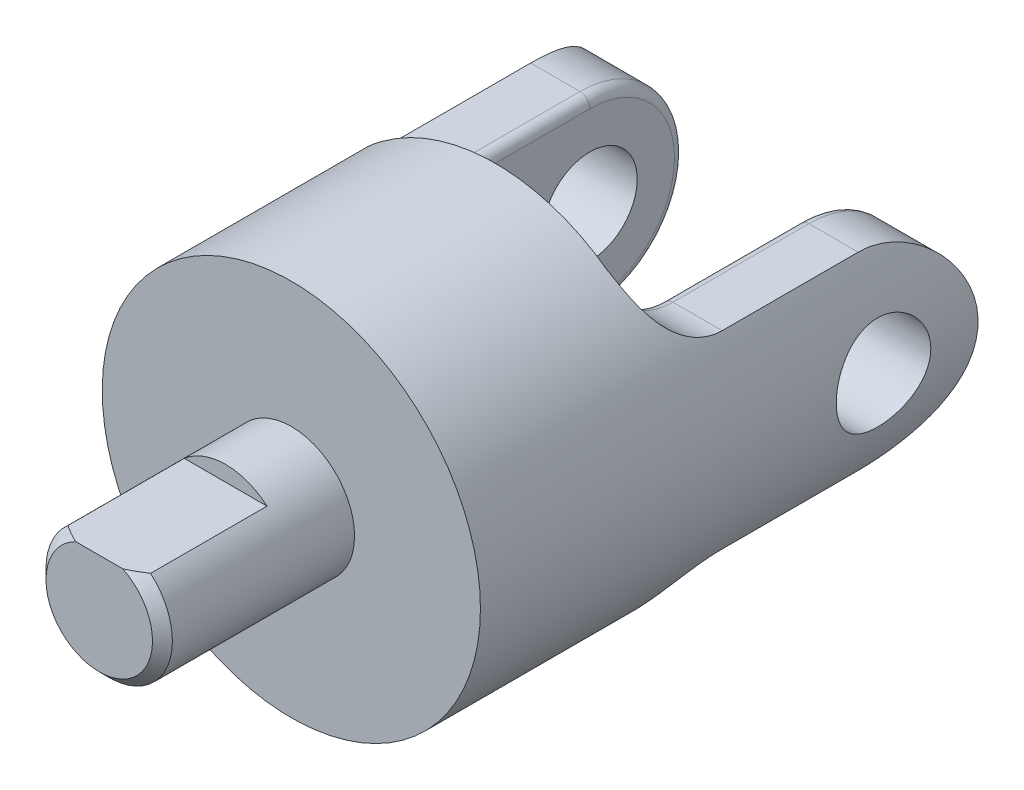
ISO-10303-21;
HEADER;
FILE_DESCRIPTION(('STEP AP214'),'2;1');
FILE_NAME('part.step','',(''),(''),'','','');
FILE_SCHEMA(('AUTOMOTIVE_DESIGN { 1 0 10303 214 1 1 1 1 }'));
ENDSEC;
DATA;
#1=APPLICATION_CONTEXT('core data for automotive mechanical design processes');
#2=APPLICATION_PROTOCOL_DEFINITION('international standard','automotive_design',2000,#1);
#3=PRODUCT_CONTEXT('',#1,'mechanical');
#4=PRODUCT('Part','Part','',(#3));
#5=PRODUCT_RELATED_PRODUCT_CATEGORY('part','',(#4));
#6=PRODUCT_DEFINITION_FORMATION('','',#4);
#7=PRODUCT_DEFINITION_CONTEXT('part definition',#1,'design');
#8=PRODUCT_DEFINITION('design','',#6,#7);
#9=PRODUCT_DEFINITION_SHAPE('','',#8);
#10=(LENGTH_UNIT() NAMED_UNIT(*) SI_UNIT(.MILLI.,.METRE.));
#11=(NAMED_UNIT(*) PLANE_ANGLE_UNIT() SI_UNIT($,.RADIAN.));
#12=(NAMED_UNIT(*) SI_UNIT($,.STERADIAN.) SOLID_ANGLE_UNIT());
#13=UNCERTAINTY_MEASURE_WITH_UNIT(LENGTH_MEASURE(1.E-05),#10,'distance_accuracy_value','');
#14=(GEOMETRIC_REPRESENTATION_CONTEXT(3) GLOBAL_UNCERTAINTY_ASSIGNED_CONTEXT((#13)) GLOBAL_UNIT_ASSIGNED_CONTEXT((#10,
#11,#12)) REPRESENTATION_CONTEXT('',''));
#15=CARTESIAN_POINT('',(0.,0.,0.));
#16=DIRECTION('',(0.,0.,1.));
#17=DIRECTION('',(1.,0.,0.));
#18=AXIS2_PLACEMENT_3D('',#15,#16,#17);
#19=CARTESIAN_POINT('',(0.,0.,50.));
#20=DIRECTION('',(0.,0.,1.));
#21=DIRECTION('',(1.,0.,0.));
#22=AXIS2_PLACEMENT_3D('',#19,#20,#21);
#23=PLANE('',#22);
#24=CARTESIAN_POINT('',(0.,0.,50.));
#25=DIRECTION('',(0.,0.,1.));
#26=DIRECTION('',(1.,0.,0.));
#27=AXIS2_PLACEMENT_3D('',#24,#25,#26);
#28=CIRCLE('',#27,19.);
#29=CARTESIAN_POINT('',(19.,0.,50.));
#30=VERTEX_POINT('',#29);
#31=EDGE_CURVE('E309',#30,#30,#28,.T.);
#32=ORIENTED_EDGE('',*,*,#31,.T.);
#33=EDGE_LOOP('',(#32));
#34=FACE_BOUND('',#33,.T.);
#35=CARTESIAN_POINT('',(0.,0.,50.));
#36=DIRECTION('',(0.,0.,1.));
#37=DIRECTION('',(1.,0.,0.));
#38=AXIS2_PLACEMENT_3D('',#35,#36,#37);
#39=CIRCLE('',#38,6.35);
#40=CARTESIAN_POINT('',(6.35,0.,50.));
#41=VERTEX_POINT('',#40);
#42=EDGE_CURVE('E201',#41,#41,#39,.T.);
#43=ORIENTED_EDGE('',*,*,#42,.F.);
#44=EDGE_LOOP('',(#43));
#45=FACE_BOUND('',#44,.T.);
#46=ADVANCED_FACE('F33',(#34,#45),#23,.T.);
#47=CARTESIAN_POINT('',(0.,0.,50.));
#48=DIRECTION('',(0.,0.,-1.));
#49=DIRECTION('',(-1.,0.,0.));
#50=AXIS2_PLACEMENT_3D('',#47,#48,#49);
#51=CYLINDRICAL_SURFACE('',#50,19.);
#52=CARTESIAN_POINT('',(-19.,0.,14.25));
#53=CARTESIAN_POINT('',(-18.9999955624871,-0.262440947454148,14.2499926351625));
#54=CARTESIAN_POINT('',(-18.9945083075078,-0.524964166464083,14.228176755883));
#55=CARTESIAN_POINT('',(-18.97315027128,-1.04248669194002,14.1416203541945));
#56=CARTESIAN_POINT('',(-18.9572736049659,-1.29748164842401,14.0768555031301));
#57=CARTESIAN_POINT('',(-18.9168948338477,-1.79239942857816,13.9066090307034));
#58=CARTESIAN_POINT('',(-18.8924030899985,-2.03233995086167,13.8011763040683));
#59=CARTESIAN_POINT('',(-18.837402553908,-2.49112841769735,13.5527589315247));
#60=CARTESIAN_POINT('',(-18.806893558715,-2.70997565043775,13.4097730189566));
#61=CARTESIAN_POINT('',(-18.7424680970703,-3.12487276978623,13.0871974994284));
#62=CARTESIAN_POINT('',(-18.7084990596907,-3.32042635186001,12.9069800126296));
#63=CARTESIAN_POINT('',(-18.6413313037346,-3.67887160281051,12.5164013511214));
#64=CARTESIAN_POINT('',(-18.6081326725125,-3.84175958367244,12.3060367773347));
#65=CARTESIAN_POINT('',(-18.5457345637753,-4.13258405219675,11.8572817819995));
#66=CARTESIAN_POINT('',(-18.516601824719,-4.25996535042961,11.6185214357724));
#67=CARTESIAN_POINT('',(-18.4664006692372,-4.47259021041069,11.1221300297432));
#68=CARTESIAN_POINT('',(-18.4453309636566,-4.55784050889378,10.8645019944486));
#69=CARTESIAN_POINT('',(-18.4141817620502,-4.68209031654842,10.3431455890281));
#70=CARTESIAN_POINT('',(-18.4038905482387,-4.7219821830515,10.079642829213));
#71=CARTESIAN_POINT('',(-18.3948298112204,-4.75716228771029,9.54949953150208));
#72=CARTESIAN_POINT('',(-18.3960584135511,-4.75245778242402,9.28285951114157));
#73=CARTESIAN_POINT('',(-18.4097081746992,-4.69929066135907,8.76084994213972));
#74=CARTESIAN_POINT('',(-18.4218573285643,-4.65189141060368,8.50536386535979));
#75=CARTESIAN_POINT('',(-18.4555458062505,-4.51637659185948,8.00609000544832));
#76=CARTESIAN_POINT('',(-18.4770857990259,-4.42825812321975,7.76230305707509));
#77=CARTESIAN_POINT('',(-18.5273786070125,-4.21290001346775,7.29049628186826));
#78=CARTESIAN_POINT('',(-18.5562020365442,-4.08527444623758,7.0626604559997));
#79=CARTESIAN_POINT('',(-18.6177741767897,-3.79479487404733,6.6312574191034));
#80=CARTESIAN_POINT('',(-18.6505235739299,-3.63193470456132,6.42769446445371));
#81=CARTESIAN_POINT('',(-18.7174028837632,-3.27010084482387,6.04452188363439));
#82=CARTESIAN_POINT('',(-18.75154553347,-3.07022981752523,5.86576078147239));
#83=CARTESIAN_POINT('',(-18.8165222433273,-2.64293773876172,5.54413273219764));
#84=CARTESIAN_POINT('',(-18.8473562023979,-2.41551584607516,5.40126688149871));
#85=CARTESIAN_POINT('',(-18.9023948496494,-1.93836698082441,5.15517314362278));
#86=CARTESIAN_POINT('',(-18.9265764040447,-1.68856607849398,5.05208308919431));
#87=CARTESIAN_POINT('',(-18.9654173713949,-1.17444069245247,4.88959519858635));
#88=CARTESIAN_POINT('',(-18.9800786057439,-0.910118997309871,4.8301890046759));
#89=CARTESIAN_POINT('',(-18.9979574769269,-0.381709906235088,4.75805104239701));
#90=CARTESIAN_POINT('',(-19.0014583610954,-0.117789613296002,4.74416375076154));
#91=CARTESIAN_POINT('',(-18.9974288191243,0.408604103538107,4.76028850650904));
#92=CARTESIAN_POINT('',(-18.989899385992,0.671077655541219,4.79029660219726));
#93=CARTESIAN_POINT('',(-18.9648367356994,1.18311185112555,4.89240787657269));
#94=CARTESIAN_POINT('',(-18.9474534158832,1.4328062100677,4.96388066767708));
#95=CARTESIAN_POINT('',(-18.9046423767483,1.9166480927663,5.14617243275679));
#96=CARTESIAN_POINT('',(-18.8792138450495,2.15079404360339,5.2569953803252));
#97=CARTESIAN_POINT('',(-18.8224547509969,2.60148992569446,5.51708107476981));
#98=CARTESIAN_POINT('',(-18.7910274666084,2.81765389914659,5.66699102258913));
#99=CARTESIAN_POINT('',(-18.7259094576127,3.22216760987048,6.00016804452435));
#100=CARTESIAN_POINT('',(-18.6922183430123,3.41051253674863,6.18344087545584));
#101=CARTESIAN_POINT('',(-18.6253503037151,3.75880346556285,6.58350620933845));
#102=CARTESIAN_POINT('',(-18.592206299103,3.91793891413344,6.80101105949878));
#103=CARTESIAN_POINT('',(-18.5311078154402,4.19745073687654,7.26032000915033));
#104=CARTESIAN_POINT('',(-18.5031531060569,4.31782883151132,7.50212302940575));
#105=CARTESIAN_POINT('',(-18.4559063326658,4.51551283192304,8.00186812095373));
#106=CARTESIAN_POINT('',(-18.4365630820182,4.59307392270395,8.25970415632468));
#107=CARTESIAN_POINT('',(-18.4086802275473,4.70359458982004,8.78531385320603));
#108=CARTESIAN_POINT('',(-18.4001382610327,4.73656392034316,9.05308532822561));
#109=CARTESIAN_POINT('',(-18.3950052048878,4.75645553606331,9.5827165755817));
#110=CARTESIAN_POINT('',(-18.3980778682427,4.7446733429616,9.84452521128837));
#111=CARTESIAN_POINT('',(-18.4150504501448,4.67836138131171,10.362295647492));
#112=CARTESIAN_POINT('',(-18.428950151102,4.62383247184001,10.6182575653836));
#113=CARTESIAN_POINT('',(-18.4658232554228,4.47428251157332,11.1156601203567));
#114=CARTESIAN_POINT('',(-18.4887421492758,4.37950444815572,11.3571781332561));
#115=CARTESIAN_POINT('',(-18.5410789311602,4.15233889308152,11.8210570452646));
#116=CARTESIAN_POINT('',(-18.570497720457,4.01994618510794,12.0434152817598));
#117=CARTESIAN_POINT('',(-18.6334784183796,3.7172478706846,12.4689229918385));
#118=CARTESIAN_POINT('',(-18.6671283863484,3.54604334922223,12.6714200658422));
#119=CARTESIAN_POINT('',(-18.734254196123,3.17233300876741,13.0452323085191));
#120=CARTESIAN_POINT('',(-18.7677299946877,2.96981976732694,13.2165400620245));
#121=CARTESIAN_POINT('',(-18.8314590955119,2.53481402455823,13.5261358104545));
#122=CARTESIAN_POINT('',(-18.8616430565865,2.3018450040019,13.66376960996));
#123=CARTESIAN_POINT('',(-18.9146559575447,1.81534252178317,13.8977002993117));
#124=CARTESIAN_POINT('',(-18.9374901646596,1.56182395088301,13.9940268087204));
#125=CARTESIAN_POINT('',(-18.9698552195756,1.09063246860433,14.1283107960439));
#126=CARTESIAN_POINT('',(-18.9810818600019,0.875203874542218,14.1738456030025));
#127=CARTESIAN_POINT('',(-18.996155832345,0.439869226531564,14.2346921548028));
#128=CARTESIAN_POINT('',(-19.0000037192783,0.219963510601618,14.2500061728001));
#129=CARTESIAN_POINT('',(-19.,0.,14.25));
#130=B_SPLINE_CURVE_WITH_KNOTS('',3,(#52,#53,#54,#55,#56,#57,#58,#59,#60,#61,#62,#63,#64,#65,
#66,#67,#68,#69,#70,#71,#72,#73,#74,#75,#76,#77,#78,#79,#80,#81,#82,#83,#84,#85,#86,#87,#88,#89,
#90,#91,#92,#93,#94,#95,#96,#97,#98,#99,#100,#101,#102,#103,#104,#105,#106,#107,#108,#109,#110,
#111,#112,#113,#114,#115,#116,#117,#118,#119,#120,#121,#122,#123,#124,#125,#126,#127,#128,#129),
.UNSPECIFIED.,.T.,.F.,(4,2,2,2,2,2,2,2,2,2,2,2,2,2,2,2,2,2,2,2,2,2,2,2,2,2,2,2,2,2,2,2,2,2,2,2,
2,2,4),(0.,0.786516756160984,1.57347941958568,2.35949885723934,3.1455448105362,3.94612378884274,
4.74679310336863,5.55935717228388,6.37179127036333,7.16794934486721,7.96397787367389,
8.74071240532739,9.5175022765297,10.302133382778,11.0869018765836,11.8940475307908,
12.7012178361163,13.5111605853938,14.3209483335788,15.1100131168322,15.8990068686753,
16.6763086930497,17.4536890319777,18.2448636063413,19.0361748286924,19.8469094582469,
20.6576080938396,21.4634213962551,22.2690584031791,23.0515530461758,23.8340319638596,
24.6118526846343,25.389781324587,26.1880032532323,26.9864147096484,27.7992858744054,
28.6115731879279,29.2708376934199,29.9300526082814),.UNSPECIFIED.);
#131=CARTESIAN_POINT('',(-19.,0.,14.25));
#132=VERTEX_POINT('',#131);
#133=EDGE_CURVE('E300',#132,#132,#130,.T.);
#134=ORIENTED_EDGE('',*,*,#133,.T.);
#135=EDGE_LOOP('',(#134));
#136=FACE_BOUND('',#135,.T.);
#137=CARTESIAN_POINT('',(19.,0.,4.75));
#138=CARTESIAN_POINT('',(18.9999955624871,-0.262440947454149,4.7500073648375));
#139=CARTESIAN_POINT('',(18.9945083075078,-0.524964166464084,4.77182324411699));
#140=CARTESIAN_POINT('',(18.97315027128,-1.04248669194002,4.85837964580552));
#141=CARTESIAN_POINT('',(18.9572736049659,-1.29748164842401,4.92314449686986));
#142=CARTESIAN_POINT('',(18.9168948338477,-1.79239942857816,5.0933909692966));
#143=CARTESIAN_POINT('',(18.8924030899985,-2.03233995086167,5.19882369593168));
#144=CARTESIAN_POINT('',(18.837402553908,-2.49112841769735,5.44724106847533));
#145=CARTESIAN_POINT('',(18.806893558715,-2.70997565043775,5.5902269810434));
#146=CARTESIAN_POINT('',(18.7424680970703,-3.12487276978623,5.91280250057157));
#147=CARTESIAN_POINT('',(18.7084990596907,-3.32042635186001,6.09301998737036));
#148=CARTESIAN_POINT('',(18.6413313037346,-3.67887160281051,6.48359864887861));
#149=CARTESIAN_POINT('',(18.6081326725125,-3.84175958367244,6.6939632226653));
#150=CARTESIAN_POINT('',(18.5457345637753,-4.13258405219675,7.14271821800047));
#151=CARTESIAN_POINT('',(18.516601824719,-4.25996535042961,7.38147856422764));
#152=CARTESIAN_POINT('',(18.4664006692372,-4.47259021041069,7.87786997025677));
#153=CARTESIAN_POINT('',(18.4453309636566,-4.55784050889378,8.13549800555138));
#154=CARTESIAN_POINT('',(18.4141817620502,-4.68209031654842,8.65685441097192));
#155=CARTESIAN_POINT('',(18.4038905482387,-4.7219821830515,8.92035717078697));
#156=CARTESIAN_POINT('',(18.3948298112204,-4.75716228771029,9.45050046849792));
#157=CARTESIAN_POINT('',(18.3960584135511,-4.75245778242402,9.71714048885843));
#158=CARTESIAN_POINT('',(18.4097081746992,-4.69929066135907,10.2391500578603));
#159=CARTESIAN_POINT('',(18.4218573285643,-4.65189141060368,10.4946361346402));
#160=CARTESIAN_POINT('',(18.4555458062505,-4.51637659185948,10.9939099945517));
#161=CARTESIAN_POINT('',(18.4770857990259,-4.42825812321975,11.2376969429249));
#162=CARTESIAN_POINT('',(18.5273786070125,-4.21290001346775,11.7095037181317));
#163=CARTESIAN_POINT('',(18.5562020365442,-4.08527444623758,11.9373395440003));
#164=CARTESIAN_POINT('',(18.6177741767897,-3.79479487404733,12.3687425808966));
#165=CARTESIAN_POINT('',(18.6505235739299,-3.63193470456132,12.5723055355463));
#166=CARTESIAN_POINT('',(18.7174028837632,-3.27010084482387,12.9554781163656));
#167=CARTESIAN_POINT('',(18.75154553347,-3.07022981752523,13.1342392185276));
#168=CARTESIAN_POINT('',(18.8165222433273,-2.64293773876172,13.4558672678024));
#169=CARTESIAN_POINT('',(18.8473562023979,-2.41551584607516,13.5987331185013));
#170=CARTESIAN_POINT('',(18.9023948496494,-1.93836698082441,13.8448268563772));
#171=CARTESIAN_POINT('',(18.9265764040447,-1.68856607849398,13.9479169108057));
#172=CARTESIAN_POINT('',(18.9654173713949,-1.17444069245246,14.1104048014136));
#173=CARTESIAN_POINT('',(18.9800786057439,-0.910118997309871,14.1698109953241));
#174=CARTESIAN_POINT('',(18.9979574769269,-0.381709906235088,14.241948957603));
#175=CARTESIAN_POINT('',(19.0014583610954,-0.117789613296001,14.2558362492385));
#176=CARTESIAN_POINT('',(18.9974288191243,0.408604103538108,14.239711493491));
#177=CARTESIAN_POINT('',(18.989899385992,0.671077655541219,14.2097033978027));
#178=CARTESIAN_POINT('',(18.9648367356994,1.18311185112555,14.1075921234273));
#179=CARTESIAN_POINT('',(18.9474534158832,1.43280621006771,14.0361193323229));
#180=CARTESIAN_POINT('',(18.9046423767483,1.9166480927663,13.8538275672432));
#181=CARTESIAN_POINT('',(18.8792138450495,2.15079404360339,13.7430046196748));
#182=CARTESIAN_POINT('',(18.8224547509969,2.60148992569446,13.4829189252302));
#183=CARTESIAN_POINT('',(18.7910274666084,2.81765389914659,13.3330089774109));
#184=CARTESIAN_POINT('',(18.7259094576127,3.22216760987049,12.9998319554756));
#185=CARTESIAN_POINT('',(18.6922183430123,3.41051253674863,12.8165591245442));
#186=CARTESIAN_POINT('',(18.6253503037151,3.75880346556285,12.4164937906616));
#187=CARTESIAN_POINT('',(18.592206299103,3.91793891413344,12.1989889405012));
#188=CARTESIAN_POINT('',(18.5311078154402,4.19745073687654,11.7396799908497));
#189=CARTESIAN_POINT('',(18.5031531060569,4.31782883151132,11.4978769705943));
#190=CARTESIAN_POINT('',(18.4559063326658,4.51551283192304,10.9981318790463));
#191=CARTESIAN_POINT('',(18.4365630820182,4.59307392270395,10.7402958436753));
#192=CARTESIAN_POINT('',(18.4086802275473,4.70359458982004,10.214686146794));
#193=CARTESIAN_POINT('',(18.4001382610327,4.73656392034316,9.94691467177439));
#194=CARTESIAN_POINT('',(18.3950052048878,4.75645553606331,9.4172834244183));
#195=CARTESIAN_POINT('',(18.3980778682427,4.74467334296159,9.15547478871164));
#196=CARTESIAN_POINT('',(18.4150504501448,4.67836138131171,8.63770435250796));
#197=CARTESIAN_POINT('',(18.428950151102,4.62383247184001,8.38174243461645));
#198=CARTESIAN_POINT('',(18.4658232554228,4.47428251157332,7.88433987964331));
#199=CARTESIAN_POINT('',(18.4887421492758,4.37950444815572,7.64282186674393));
#200=CARTESIAN_POINT('',(18.5410789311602,4.15233889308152,7.1789429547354));
#201=CARTESIAN_POINT('',(18.570497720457,4.01994618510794,6.95658471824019));
#202=CARTESIAN_POINT('',(18.6334784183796,3.7172478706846,6.53107700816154));
#203=CARTESIAN_POINT('',(18.6671283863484,3.54604334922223,6.32857993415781));
#204=CARTESIAN_POINT('',(18.734254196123,3.1723330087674,5.95476769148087));
#205=CARTESIAN_POINT('',(18.7677299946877,2.96981976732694,5.78345993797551));
#206=CARTESIAN_POINT('',(18.8314590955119,2.53481402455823,5.47386418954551));
#207=CARTESIAN_POINT('',(18.8616430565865,2.3018450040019,5.33623039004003));
#208=CARTESIAN_POINT('',(18.9146559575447,1.81534252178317,5.1022997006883));
#209=CARTESIAN_POINT('',(18.9374901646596,1.56182395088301,5.00597319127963));
#210=CARTESIAN_POINT('',(18.9698552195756,1.09063246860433,4.8716892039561));
#211=CARTESIAN_POINT('',(18.9810818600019,0.875203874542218,4.82615439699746));
#212=CARTESIAN_POINT('',(18.996155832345,0.439869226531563,4.76530784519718));
#213=CARTESIAN_POINT('',(19.0000037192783,0.219963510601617,4.74999382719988));
#214=CARTESIAN_POINT('',(19.,0.,4.75));
#215=B_SPLINE_CURVE_WITH_KNOTS('',3,(#137,#138,#139,#140,#141,#142,#143,#144,#145,#146,#147,
#148,#149,#150,#151,#152,#153,#154,#155,#156,#157,#158,#159,#160,#161,#162,#163,#164,#165,#166,
#167,#168,#169,#170,#171,#172,#173,#174,#175,#176,#177,#178,#179,#180,#181,#182,#183,#184,#185,
#186,#187,#188,#189,#190,#191,#192,#193,#194,#195,#196,#197,#198,#199,#200,#201,#202,#203,#204,
#205,#206,#207,#208,#209,#210,#211,#212,#213,#214),.UNSPECIFIED.,.T.,.F.,(4,2,2,2,2,2,2,2,2,2,2,
2,2,2,2,2,2,2,2,2,2,2,2,2,2,2,2,2,2,2,2,2,2,2,2,2,2,2,4),(0.,0.786516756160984,1.57347941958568,
2.35949885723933,3.1455448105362,3.94612378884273,4.74679310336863,5.55935717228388,
6.37179127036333,7.16794934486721,7.96397787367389,8.7407124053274,9.51750227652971,
10.302133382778,11.0869018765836,11.8940475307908,12.7012178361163,13.5111605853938,
14.3209483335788,15.1100131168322,15.8990068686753,16.6763086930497,17.4536890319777,
18.2448636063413,19.0361748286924,19.8469094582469,20.6576080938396,21.4634213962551,
22.2690584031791,23.0515530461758,23.8340319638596,24.6118526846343,25.389781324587,
26.1880032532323,26.9864147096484,27.7992858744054,28.6115731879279,29.2708376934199,
29.9300526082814),.UNSPECIFIED.);
#216=CARTESIAN_POINT('',(19.,0.,4.75));
#217=VERTEX_POINT('',#216);
#218=EDGE_CURVE('E296',#217,#217,#215,.T.);
#219=ORIENTED_EDGE('',*,*,#218,.T.);
#220=EDGE_LOOP('',(#219));
#221=FACE_BOUND('',#220,.T.);
#222=ORIENTED_EDGE('',*,*,#31,.F.);
#223=EDGE_LOOP('',(#222));
#224=FACE_BOUND('',#223,.T.);
#225=CARTESIAN_POINT('',(-11.5,-15.1244834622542,29.4600197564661));
#226=CARTESIAN_POINT('',(-11.463702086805,-15.1520780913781,29.4631211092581));
#227=CARTESIAN_POINT('',(-11.4275187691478,-15.1793865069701,29.4680034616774));
#228=CARTESIAN_POINT('',(-11.3553811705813,-15.2334310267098,29.4813301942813));
#229=CARTESIAN_POINT('',(-11.3194268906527,-15.2601671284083,29.4897745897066));
#230=CARTESIAN_POINT('',(-11.2835872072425,-15.2866170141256,29.5));
#231=B_SPLINE_CURVE_WITH_KNOTS('',3,(#225,#226,#227,#228,#229,#230),.UNSPECIFIED.,.F.,.F.,(4,2,
4),(0.,0.136782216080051,0.273565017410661),.UNSPECIFIED.);
#232=CARTESIAN_POINT('',(-11.5,-15.1244834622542,29.4600197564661));
#233=VERTEX_POINT('',#232);
#234=CARTESIAN_POINT('',(-11.2835872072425,-15.2866170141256,29.5));
#235=VERTEX_POINT('',#234);
#236=EDGE_CURVE('E415',#233,#235,#231,.T.);
#237=ORIENTED_EDGE('',*,*,#236,.T.);
#238=CARTESIAN_POINT('',(0.,0.,29.5));
#239=DIRECTION('',(0.,0.,1.));
#240=DIRECTION('',(1.,0.,0.));
#241=AXIS2_PLACEMENT_3D('',#238,#239,#240);
#242=CIRCLE('',#241,19.);
#243=CARTESIAN_POINT('',(11.2835872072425,-15.2866170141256,29.5));
#244=VERTEX_POINT('',#243);
#245=EDGE_CURVE('E314',#235,#244,#242,.T.);
#246=ORIENTED_EDGE('',*,*,#245,.T.);
#247=CARTESIAN_POINT('',(11.2835872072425,-15.2866170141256,29.5));
#248=CARTESIAN_POINT('',(11.3194268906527,-15.2601671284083,29.4897745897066));
#249=CARTESIAN_POINT('',(11.3553811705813,-15.2334310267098,29.4813301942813));
#250=CARTESIAN_POINT('',(11.4275187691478,-15.1793865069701,29.4680034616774));
#251=CARTESIAN_POINT('',(11.463702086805,-15.1520780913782,29.4631211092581));
#252=CARTESIAN_POINT('',(11.5,-15.1244834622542,29.4600197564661));
#253=B_SPLINE_CURVE_WITH_KNOTS('',3,(#247,#248,#249,#250,#251,#252),.UNSPECIFIED.,.F.,.F.,(4,2,
4),(0.,0.136782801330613,0.273565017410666),.UNSPECIFIED.);
#254=CARTESIAN_POINT('',(11.5,-15.1244834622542,29.4600197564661));
#255=VERTEX_POINT('',#254);
#256=EDGE_CURVE('E407',#244,#255,#253,.T.);
#257=ORIENTED_EDGE('',*,*,#256,.T.);
#258=CARTESIAN_POINT('',(16.4544826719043,-9.5,23.1649123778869));
#259=CARTESIAN_POINT('',(16.4544807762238,-9.49997285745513,23.322221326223));
#260=CARTESIAN_POINT('',(16.4510999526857,-9.5058581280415,23.4795250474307));
#261=CARTESIAN_POINT('',(16.4375668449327,-9.52925669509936,23.7929496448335));
#262=CARTESIAN_POINT('',(16.4274155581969,-9.5467682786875,23.9490706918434));
#263=CARTESIAN_POINT('',(16.4003614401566,-9.59316530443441,24.258621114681));
#264=CARTESIAN_POINT('',(16.3834753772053,-9.62202249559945,24.4120561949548));
#265=CARTESIAN_POINT('',(16.3429291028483,-9.69073105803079,24.715530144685));
#266=CARTESIAN_POINT('',(16.3192688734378,-9.73058245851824,24.8655690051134));
#267=CARTESIAN_POINT('',(16.2651551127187,-9.82076822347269,25.1612047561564));
#268=CARTESIAN_POINT('',(16.2347014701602,-9.8711027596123,25.3068015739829));
#269=CARTESIAN_POINT('',(16.1669938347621,-9.9816084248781,25.5925837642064));
#270=CARTESIAN_POINT('',(16.1297395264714,-10.0417800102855,25.7327688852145));
#271=CARTESIAN_POINT('',(16.0484487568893,-10.1711910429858,26.006844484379));
#272=CARTESIAN_POINT('',(16.004412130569,-10.2404307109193,26.1407348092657));
#273=CARTESIAN_POINT('',(15.9096097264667,-10.3871045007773,26.4014519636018));
#274=CARTESIAN_POINT('',(15.8588438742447,-10.4645387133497,26.5282787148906));
#275=CARTESIAN_POINT('',(15.7495033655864,-10.6284077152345,26.7769013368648));
#276=CARTESIAN_POINT('',(15.6907832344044,-10.7150012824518,26.8985284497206));
#277=CARTESIAN_POINT('',(15.5665478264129,-10.8947015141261,27.1332593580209));
#278=CARTESIAN_POINT('',(15.5010302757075,-10.9878103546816,27.246360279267));
#279=CARTESIAN_POINT('',(15.3634277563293,-11.1794003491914,27.4636199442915));
#280=CARTESIAN_POINT('',(15.2913436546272,-11.277880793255,27.5677798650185));
#281=CARTESIAN_POINT('',(15.1408268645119,-11.4791620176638,27.7670107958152));
#282=CARTESIAN_POINT('',(15.0623918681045,-11.5819643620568,27.8620784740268));
#283=CARTESIAN_POINT('',(14.8917422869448,-11.8007216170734,28.0516408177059));
#284=CARTESIAN_POINT('',(14.7989265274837,-11.9169981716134,28.1452228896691));
#285=CARTESIAN_POINT('',(14.6064503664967,-12.1521482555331,28.3215492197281));
#286=CARTESIAN_POINT('',(14.5067872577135,-12.2710227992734,28.4042891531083));
#287=CARTESIAN_POINT('',(14.3010775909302,-12.5101580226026,28.5592130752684));
#288=CARTESIAN_POINT('',(14.195029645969,-12.6304189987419,28.631394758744));
#289=CARTESIAN_POINT('',(13.9770246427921,-12.871254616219,28.7656305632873));
#290=CARTESIAN_POINT('',(13.86506627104,-12.9918293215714,28.8276824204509));
#291=CARTESIAN_POINT('',(13.5722231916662,-13.298920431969,28.9738706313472));
#292=CARTESIAN_POINT('',(13.3874761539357,-13.4850100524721,29.0512300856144));
#293=CARTESIAN_POINT('',(13.0064498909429,-13.8528879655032,29.1850935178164));
#294=CARTESIAN_POINT('',(12.8101644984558,-14.034673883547,29.2415862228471));
#295=CARTESIAN_POINT('',(12.4072983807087,-14.3920664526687,29.3362371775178));
#296=CARTESIAN_POINT('',(12.2007021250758,-14.5676630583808,29.3743667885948));
#297=CARTESIAN_POINT('',(11.7788605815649,-14.9108133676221,29.4346324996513));
#298=CARTESIAN_POINT('',(11.5636185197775,-15.0783700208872,29.4567745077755));
#299=CARTESIAN_POINT('',(11.2064161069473,-15.3442474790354,29.4818009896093));
#300=CARTESIAN_POINT('',(11.0667359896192,-15.4452929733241,29.4887770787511));
#301=CARTESIAN_POINT('',(10.7851261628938,-15.6432277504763,29.4978647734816));
#302=CARTESIAN_POINT('',(10.6432074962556,-15.7401318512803,29.4999954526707));
#303=CARTESIAN_POINT('',(10.5,-15.8350876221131,29.5));
#304=B_SPLINE_CURVE_WITH_KNOTS('',3,(#258,#259,#260,#261,#262,#263,#264,#265,#266,#267,#268,
#269,#270,#271,#272,#273,#274,#275,#276,#277,#278,#279,#280,#281,#282,#283,#284,#285,#286,#287,
#288,#289,#290,#291,#292,#293,#294,#295,#296,#297,#298,#299,#300,#301,#302,#303),.UNSPECIFIED.,
.F.,.F.,(4,2,2,2,2,2,2,2,2,2,2,2,2,2,2,2,2,2,2,2,2,2,4),(0.,0.471772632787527,0.943475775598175,
1.41401172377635,1.88454892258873,2.35509382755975,2.82566056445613,3.29623875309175,
3.7668221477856,4.24761122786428,4.72856166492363,5.20944869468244,5.69051127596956,
6.21727922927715,6.74425666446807,7.27134898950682,7.79855895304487,8.61747012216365,
9.43682304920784,10.2574497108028,11.0777729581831,11.5952664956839,12.1107194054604),.UNSPECIFIED.);
#305=CARTESIAN_POINT('',(16.4544826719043,-9.5,23.1649123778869));
#306=VERTEX_POINT('',#305);
#307=EDGE_CURVE('E219',#306,#255,#304,.T.);
#308=ORIENTED_EDGE('',*,*,#307,.F.);
#309=DIRECTION('',(0.,0.,-1.));
#310=VECTOR('',#309,1.);
#311=CARTESIAN_POINT('',(16.4544826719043,-9.5,50.));
#312=LINE('',#311,#310);
#313=CARTESIAN_POINT('',(16.4544826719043,-9.5,9.5));
#314=VERTEX_POINT('',#313);
#315=EDGE_CURVE('E213',#314,#306,#312,.F.);
#316=ORIENTED_EDGE('',*,*,#315,.F.);
#317=CARTESIAN_POINT('',(16.4544826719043,-9.5,9.5));
#318=CARTESIAN_POINT('',(16.4544798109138,-9.50000093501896,9.37559946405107));
#319=CARTESIAN_POINT('',(16.4558940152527,-9.49755596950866,9.25121647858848));
#320=CARTESIAN_POINT('',(16.4615272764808,-9.48779036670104,9.00271080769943));
#321=CARTESIAN_POINT('',(16.4657462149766,-9.48046993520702,8.87858811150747));
#322=CARTESIAN_POINT('',(16.4825568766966,-9.45123588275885,8.50714286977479));
#323=CARTESIAN_POINT('',(16.4993025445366,-9.42204944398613,8.26053115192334));
#324=CARTESIAN_POINT('',(16.5431196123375,-9.34489858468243,7.77270911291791));
#325=CARTESIAN_POINT('',(16.5701311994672,-9.29704289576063,7.53147591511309));
#326=CARTESIAN_POINT('',(16.6335264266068,-9.183138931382,7.05458257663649));
#327=CARTESIAN_POINT('',(16.6699111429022,-9.1170885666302,6.81892307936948));
#328=CARTESIAN_POINT('',(16.7507499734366,-8.96769538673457,6.35522164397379));
#329=CARTESIAN_POINT('',(16.7951846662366,-8.88439412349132,6.12716290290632));
#330=CARTESIAN_POINT('',(16.890831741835,-8.70117662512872,5.67924957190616));
#331=CARTESIAN_POINT('',(16.9420467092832,-8.60125405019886,5.45939815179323));
#332=CARTESIAN_POINT('',(17.103829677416,-8.27751737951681,4.81334164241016));
#333=CARTESIAN_POINT('',(17.2224882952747,-8.02981801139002,4.40089126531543));
#334=CARTESIAN_POINT('',(17.4797396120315,-7.4542361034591,3.58795042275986));
#335=CARTESIAN_POINT('',(17.6191689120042,-7.12145450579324,3.19119305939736));
#336=CARTESIAN_POINT('',(17.826294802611,-6.57731676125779,2.6402852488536));
#337=CARTESIAN_POINT('',(17.8950376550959,-6.38832701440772,2.46393592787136));
#338=CARTESIAN_POINT('',(18.0302604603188,-5.99605651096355,2.12679467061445));
#339=CARTESIAN_POINT('',(18.0967400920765,-5.79277373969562,1.96600493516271));
#340=CARTESIAN_POINT('',(18.2302055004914,-5.35860504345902,1.65065779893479));
#341=CARTESIAN_POINT('',(18.2969168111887,-5.12678209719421,1.49727256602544));
#342=CARTESIAN_POINT('',(18.4240122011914,-4.64938138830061,1.21080834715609));
#343=CARTESIAN_POINT('',(18.4843988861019,-4.40380935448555,1.0777209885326));
#344=CARTESIAN_POINT('',(18.5970919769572,-3.90058920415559,0.833189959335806));
#345=CARTESIAN_POINT('',(18.6494050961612,-3.64295135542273,0.721728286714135));
#346=CARTESIAN_POINT('',(18.7444335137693,-3.11728784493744,0.521606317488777));
#347=CARTESIAN_POINT('',(18.787151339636,-2.84926494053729,0.432940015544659));
#348=CARTESIAN_POINT('',(18.8529118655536,-2.36895042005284,0.297560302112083));
#349=CARTESIAN_POINT('',(18.8782191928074,-2.15835204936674,0.245884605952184));
#350=CARTESIAN_POINT('',(18.9219657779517,-1.733436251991,0.156965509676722));
#351=CARTESIAN_POINT('',(18.9404058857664,-1.51911928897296,0.119720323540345));
#352=CARTESIAN_POINT('',(18.9700570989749,-1.08794731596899,0.0599926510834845));
#353=CARTESIAN_POINT('',(18.9812684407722,-0.871092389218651,0.0375096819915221));
#354=CARTESIAN_POINT('',(18.9962391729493,-0.436162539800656,0.0075151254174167));
#355=CARTESIAN_POINT('',(19.0000007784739,-0.218087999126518,-9.12416644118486E-07));
#356=CARTESIAN_POINT('',(18.9999991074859,0.250036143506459,1.04607837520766E-06));
#357=CARTESIAN_POINT('',(18.9950527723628,0.500089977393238,0.00988270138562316));
#358=CARTESIAN_POINT('',(18.9753952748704,0.998267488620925,0.0492903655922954));
#359=CARTESIAN_POINT('',(18.9606832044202,1.24639098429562,0.0788182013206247));
#360=CARTESIAN_POINT('',(18.9218690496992,1.73894564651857,0.157179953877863));
#361=CARTESIAN_POINT('',(18.8977623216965,1.98337492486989,0.206023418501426));
#362=CARTESIAN_POINT('',(18.8407741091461,2.46666642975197,0.322454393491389));
#363=CARTESIAN_POINT('',(18.8078927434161,2.70552873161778,0.390041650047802));
#364=CARTESIAN_POINT('',(18.7342995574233,3.17527035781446,0.54296626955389));
#365=CARTESIAN_POINT('',(18.6936164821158,3.40617542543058,0.62823856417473));
#366=CARTESIAN_POINT('',(18.6052853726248,3.85962944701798,0.815905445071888));
#367=CARTESIAN_POINT('',(18.5576347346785,4.08217523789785,0.918306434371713));
#368=CARTESIAN_POINT('',(18.4564734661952,4.51758023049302,1.13931457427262));
#369=CARTESIAN_POINT('',(18.402964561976,4.73044225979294,1.25791695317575));
#370=CARTESIAN_POINT('',(18.2912190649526,5.14563428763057,1.51053623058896));
#371=CARTESIAN_POINT('',(18.2329803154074,5.34795941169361,1.64456017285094));
#372=CARTESIAN_POINT('',(18.1094292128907,5.75291540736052,1.93562174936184));
#373=CARTESIAN_POINT('',(18.0439020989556,5.95483500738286,2.09355807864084));
#374=CARTESIAN_POINT('',(17.9104896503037,6.34482815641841,2.42478849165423));
#375=CARTESIAN_POINT('',(17.8426041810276,6.53290091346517,2.59808345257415));
#376=CARTESIAN_POINT('',(17.70603157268,6.89447768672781,2.95924181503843));
#377=CARTESIAN_POINT('',(17.6373438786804,7.06797084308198,3.1471158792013));
#378=CARTESIAN_POINT('',(17.5008743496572,7.39942767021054,3.53645686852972));
#379=CARTESIAN_POINT('',(17.4330926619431,7.55738884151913,3.73792597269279));
#380=CARTESIAN_POINT('',(17.2949403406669,7.86868939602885,4.16989143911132));
#381=CARTESIAN_POINT('',(17.2247849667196,8.02068963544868,4.40142467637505));
#382=CARTESIAN_POINT('',(17.0897993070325,8.3044231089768,4.87794294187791));
#383=CARTESIAN_POINT('',(17.0249667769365,8.43616490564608,5.12292222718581));
#384=CARTESIAN_POINT('',(16.9029385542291,8.67807594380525,5.62463811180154));
#385=CARTESIAN_POINT('',(16.8457306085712,8.78827993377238,5.88135493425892));
#386=CARTESIAN_POINT('',(16.7410234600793,8.98613851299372,6.40522202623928));
#387=CARTESIAN_POINT('',(16.6935214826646,9.07379954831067,6.67236928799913));
#388=CARTESIAN_POINT('',(16.6202533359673,9.20714270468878,7.14962472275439));
#389=CARTESIAN_POINT('',(16.5920078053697,9.25785030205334,7.357962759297));
#390=CARTESIAN_POINT('',(16.5429835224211,9.34516960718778,7.77840549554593));
#391=CARTESIAN_POINT('',(16.5222029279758,9.38178479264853,7.99050925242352));
#392=CARTESIAN_POINT('',(16.4886330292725,9.44066748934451,8.41810300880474));
#393=CARTESIAN_POINT('',(16.4758723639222,9.46288359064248,8.63360235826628));
#394=CARTESIAN_POINT('',(16.4587731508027,9.49256746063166,9.06606091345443));
#395=CARTESIAN_POINT('',(16.4544391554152,9.50002725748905,9.28302084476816));
#396=CARTESIAN_POINT('',(16.4544826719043,9.5,9.5));
#397=B_SPLINE_CURVE_WITH_KNOTS('',3,(#317,#318,#319,#320,#321,#322,#323,#324,#325,#326,#327,
#328,#329,#330,#331,#332,#333,#334,#335,#336,#337,#338,#339,#340,#341,#342,#343,#344,#345,#346,
#347,#348,#349,#350,#351,#352,#353,#354,#355,#356,#357,#358,#359,#360,#361,#362,#363,#364,#365,
#366,#367,#368,#369,#370,#371,#372,#373,#374,#375,#376,#377,#378,#379,#380,#381,#382,#383,#384,
#385,#386,#387,#388,#389,#390,#391,#392,#393,#394,#395,#396),.UNSPECIFIED.,.F.,.F.,(4,2,2,2,2,2,
2,2,2,2,2,2,2,2,2,2,2,2,2,2,2,2,2,2,2,2,2,2,2,2,2,2,2,2,2,2,2,2,2,4),(0.,0.373134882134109,
0.746254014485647,1.49185857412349,2.23318397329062,2.9745945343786,3.71423962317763,
4.45416748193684,5.93483715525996,7.53653194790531,8.33826125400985,9.1401037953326,
9.99661067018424,10.8527632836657,11.7082001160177,12.5634113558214,13.2177876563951,
13.8720829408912,14.5263568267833,15.180436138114,15.9303328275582,16.6802992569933,
17.4306368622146,18.1809643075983,18.9285785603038,19.6764729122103,20.4241474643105,
21.1721648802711,21.9651022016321,22.7580848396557,23.5516530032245,24.3453486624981,
25.2014286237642,26.0571457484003,26.9114706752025,27.7655510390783,28.413793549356,
29.0618759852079,29.7122597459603,30.3629947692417),.UNSPECIFIED.);
#398=CARTESIAN_POINT('',(16.4544826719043,9.5,9.5));
#399=VERTEX_POINT('',#398);
#400=EDGE_CURVE('E257',#314,#399,#397,.T.);
#401=ORIENTED_EDGE('',*,*,#400,.T.);
#402=DIRECTION('',(0.,0.,-1.));
#403=VECTOR('',#402,1.);
#404=CARTESIAN_POINT('',(16.4544826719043,9.5,50.));
#405=LINE('',#404,#403);
#406=CARTESIAN_POINT('',(16.4544826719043,9.5,23.1649123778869));
#407=VERTEX_POINT('',#406);
#408=EDGE_CURVE('E537',#399,#407,#405,.F.);
#409=ORIENTED_EDGE('',*,*,#408,.T.);
#410=CARTESIAN_POINT('',(16.4544826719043,9.5,23.1649123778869));
#411=CARTESIAN_POINT('',(16.4544807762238,9.49997285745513,23.322221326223));
#412=CARTESIAN_POINT('',(16.4510999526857,9.5058581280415,23.4795250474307));
#413=CARTESIAN_POINT('',(16.4375668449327,9.52925669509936,23.7929496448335));
#414=CARTESIAN_POINT('',(16.4274155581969,9.5467682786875,23.9490706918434));
#415=CARTESIAN_POINT('',(16.4003614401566,9.59316530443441,24.258621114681));
#416=CARTESIAN_POINT('',(16.3834753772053,9.62202249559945,24.4120561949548));
#417=CARTESIAN_POINT('',(16.3429291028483,9.69073105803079,24.715530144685));
#418=CARTESIAN_POINT('',(16.3192688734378,9.73058245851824,24.8655690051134));
#419=CARTESIAN_POINT('',(16.2651551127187,9.82076822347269,25.1612047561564));
#420=CARTESIAN_POINT('',(16.2347014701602,9.8711027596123,25.3068015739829));
#421=CARTESIAN_POINT('',(16.1669938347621,9.9816084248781,25.5925837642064));
#422=CARTESIAN_POINT('',(16.1297395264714,10.0417800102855,25.7327688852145));
#423=CARTESIAN_POINT('',(16.0484487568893,10.1711910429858,26.006844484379));
#424=CARTESIAN_POINT('',(16.004412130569,10.2404307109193,26.1407348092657));
#425=CARTESIAN_POINT('',(15.9096097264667,10.3871045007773,26.4014519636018));
#426=CARTESIAN_POINT('',(15.8588438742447,10.4645387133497,26.5282787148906));
#427=CARTESIAN_POINT('',(15.7495033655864,10.6284077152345,26.7769013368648));
#428=CARTESIAN_POINT('',(15.6907832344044,10.7150012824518,26.8985284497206));
#429=CARTESIAN_POINT('',(15.5665478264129,10.8947015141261,27.1332593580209));
#430=CARTESIAN_POINT('',(15.5010302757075,10.9878103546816,27.246360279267));
#431=CARTESIAN_POINT('',(15.3634277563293,11.1794003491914,27.4636199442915));
#432=CARTESIAN_POINT('',(15.2913436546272,11.277880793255,27.5677798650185));
#433=CARTESIAN_POINT('',(15.1408268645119,11.4791620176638,27.7670107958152));
#434=CARTESIAN_POINT('',(15.0623918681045,11.5819643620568,27.8620784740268));
#435=CARTESIAN_POINT('',(14.8917422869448,11.8007216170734,28.0516408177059));
#436=CARTESIAN_POINT('',(14.7989265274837,11.9169981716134,28.1452228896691));
#437=CARTESIAN_POINT('',(14.6064503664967,12.1521482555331,28.3215492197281));
#438=CARTESIAN_POINT('',(14.5067872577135,12.2710227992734,28.4042891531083));
#439=CARTESIAN_POINT('',(14.3010775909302,12.5101580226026,28.5592130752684));
#440=CARTESIAN_POINT('',(14.195029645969,12.6304189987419,28.631394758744));
#441=CARTESIAN_POINT('',(13.9770246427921,12.871254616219,28.7656305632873));
#442=CARTESIAN_POINT('',(13.86506627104,12.9918293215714,28.8276824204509));
#443=CARTESIAN_POINT('',(13.5722231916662,13.298920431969,28.9738706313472));
#444=CARTESIAN_POINT('',(13.3874761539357,13.4850100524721,29.0512300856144));
#445=CARTESIAN_POINT('',(13.0064498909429,13.8528879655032,29.1850935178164));
#446=CARTESIAN_POINT('',(12.8101644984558,14.034673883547,29.2415862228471));
#447=CARTESIAN_POINT('',(12.4072983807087,14.3920664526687,29.3362371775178));
#448=CARTESIAN_POINT('',(12.2007021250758,14.5676630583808,29.3743667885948));
#449=CARTESIAN_POINT('',(11.7788605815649,14.9108133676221,29.4346324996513));
#450=CARTESIAN_POINT('',(11.5636185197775,15.0783700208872,29.4567745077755));
#451=CARTESIAN_POINT('',(11.2064161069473,15.3442474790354,29.4818009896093));
#452=CARTESIAN_POINT('',(11.0667359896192,15.4452929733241,29.4887770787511));
#453=CARTESIAN_POINT('',(10.7851261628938,15.6432277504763,29.4978647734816));
#454=CARTESIAN_POINT('',(10.6432074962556,15.7401318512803,29.4999954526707));
#455=CARTESIAN_POINT('',(10.5,15.8350876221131,29.5));
#456=B_SPLINE_CURVE_WITH_KNOTS('',3,(#410,#411,#412,#413,#414,#415,#416,#417,#418,#419,#420,
#421,#422,#423,#424,#425,#426,#427,#428,#429,#430,#431,#432,#433,#434,#435,#436,#437,#438,#439,
#440,#441,#442,#443,#444,#445,#446,#447,#448,#449,#450,#451,#452,#453,#454,#455),.UNSPECIFIED.,
.F.,.F.,(4,2,2,2,2,2,2,2,2,2,2,2,2,2,2,2,2,2,2,2,2,2,4),(0.,0.471772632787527,0.943475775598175,
1.41401172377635,1.88454892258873,2.35509382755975,2.82566056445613,3.29623875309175,
3.7668221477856,4.24761122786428,4.72856166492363,5.20944869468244,5.69051127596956,
6.21727922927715,6.74425666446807,7.27134898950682,7.79855895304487,8.61747012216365,
9.43682304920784,10.2574497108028,11.0777729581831,11.5952664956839,12.1107194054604),.UNSPECIFIED.);
#457=CARTESIAN_POINT('',(11.5,15.1244834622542,29.4600197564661));
#458=VERTEX_POINT('',#457);
#459=EDGE_CURVE('E268',#407,#458,#456,.T.);
#460=ORIENTED_EDGE('',*,*,#459,.T.);
#461=CARTESIAN_POINT('',(11.5,15.1244834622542,29.4600197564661));
#462=CARTESIAN_POINT('',(11.463702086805,15.1520780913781,29.4631211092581));
#463=CARTESIAN_POINT('',(11.4275187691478,15.1793865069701,29.4680034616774));
#464=CARTESIAN_POINT('',(11.3553811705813,15.2334310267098,29.4813301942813));
#465=CARTESIAN_POINT('',(11.3194268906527,15.2601671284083,29.4897745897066));
#466=CARTESIAN_POINT('',(11.2835872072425,15.2866170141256,29.5));
#467=B_SPLINE_CURVE_WITH_KNOTS('',3,(#461,#462,#463,#464,#465,#466),.UNSPECIFIED.,.F.,.F.,(4,2,
4),(0.,0.136782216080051,0.273565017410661),.UNSPECIFIED.);
#468=CARTESIAN_POINT('',(11.2835872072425,15.2866170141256,29.5));
#469=VERTEX_POINT('',#468);
#470=EDGE_CURVE('E400',#458,#469,#467,.T.);
#471=ORIENTED_EDGE('',*,*,#470,.T.);
#472=CARTESIAN_POINT('',(-11.2835872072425,15.2866170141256,29.5));
#473=VERTEX_POINT('',#472);
#474=EDGE_CURVE('E316',#469,#473,#242,.T.);
#475=ORIENTED_EDGE('',*,*,#474,.T.);
#476=CARTESIAN_POINT('',(-11.2835872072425,15.2866170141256,29.5));
#477=CARTESIAN_POINT('',(-11.3194268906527,15.2601671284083,29.4897745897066));
#478=CARTESIAN_POINT('',(-11.3553811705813,15.2334310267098,29.4813301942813));
#479=CARTESIAN_POINT('',(-11.4275187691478,15.1793865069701,29.4680034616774));
#480=CARTESIAN_POINT('',(-11.463702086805,15.1520780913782,29.4631211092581));
#481=CARTESIAN_POINT('',(-11.5,15.1244834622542,29.4600197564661));
#482=B_SPLINE_CURVE_WITH_KNOTS('',3,(#476,#477,#478,#479,#480,#481),.UNSPECIFIED.,.F.,.F.,(4,2,
4),(0.,0.136782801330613,0.273565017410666),.UNSPECIFIED.);
#483=CARTESIAN_POINT('',(-11.5,15.1244834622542,29.4600197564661));
#484=VERTEX_POINT('',#483);
#485=EDGE_CURVE('E406',#473,#484,#482,.T.);
#486=ORIENTED_EDGE('',*,*,#485,.T.);
#487=CARTESIAN_POINT('',(-10.5,15.8350876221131,29.5));
#488=CARTESIAN_POINT('',(-10.7211976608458,15.6884450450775,29.4999759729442));
#489=CARTESIAN_POINT('',(-10.9393799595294,15.5370706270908,29.4949043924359));
#490=CARTESIAN_POINT('',(-11.3691239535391,15.2254171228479,29.4725405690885));
#491=CARTESIAN_POINT('',(-11.5806752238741,15.0651250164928,29.4552300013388));
#492=CARTESIAN_POINT('',(-11.9979507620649,14.7350159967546,29.4060078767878));
#493=CARTESIAN_POINT('',(-12.203596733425,14.5651205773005,29.373953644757));
#494=CARTESIAN_POINT('',(-12.6055775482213,14.2186399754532,29.2928865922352));
#495=CARTESIAN_POINT('',(-12.8019178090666,14.0420587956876,29.2438837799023));
#496=CARTESIAN_POINT('',(-13.1462518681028,13.7193379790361,29.1381682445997));
#497=CARTESIAN_POINT('',(-13.2961298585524,13.5740816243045,29.0848949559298));
#498=CARTESIAN_POINT('',(-13.5883012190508,13.2815949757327,28.9647396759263));
#499=CARTESIAN_POINT('',(-13.7305961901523,13.1343651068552,28.8978605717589));
#500=CARTESIAN_POINT('',(-14.0063151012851,12.8399251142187,28.7496598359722));
#501=CARTESIAN_POINT('',(-14.1397682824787,12.6927167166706,28.6683894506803));
#502=CARTESIAN_POINT('',(-14.397482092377,12.3996195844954,28.4903491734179));
#503=CARTESIAN_POINT('',(-14.5217443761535,12.2537306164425,28.3935820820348));
#504=CARTESIAN_POINT('',(-14.7415540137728,11.9879734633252,28.2003517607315));
#505=CARTESIAN_POINT('',(-14.8385500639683,11.8676095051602,28.1062161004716));
#506=CARTESIAN_POINT('',(-15.0249342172,11.63073738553,27.9063026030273));
#507=CARTESIAN_POINT('',(-15.1143238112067,11.5142284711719,27.8005270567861));
#508=CARTESIAN_POINT('',(-15.2851191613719,11.2865142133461,27.5773089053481));
#509=CARTESIAN_POINT('',(-15.3665215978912,11.1753110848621,27.4598614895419));
#510=CARTESIAN_POINT('',(-15.5209407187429,10.9598345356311,27.2136165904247));
#511=CARTESIAN_POINT('',(-15.5939573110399,10.8555611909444,27.0848189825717));
#512=CARTESIAN_POINT('',(-15.7317099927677,10.6549610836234,26.8156591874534));
#513=CARTESIAN_POINT('',(-15.7963967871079,10.5586827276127,26.6752355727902));
#514=CARTESIAN_POINT('',(-15.9168008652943,10.3762902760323,26.3842826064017));
#515=CARTESIAN_POINT('',(-15.9725179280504,10.2901764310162,26.2337530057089));
#516=CARTESIAN_POINT('',(-16.0748457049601,10.1295807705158,25.9237157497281));
#517=CARTESIAN_POINT('',(-16.1214591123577,10.0550955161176,25.7642107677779));
#518=CARTESIAN_POINT('',(-16.2055473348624,9.91900406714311,25.4374878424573));
#519=CARTESIAN_POINT('',(-16.2430230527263,9.8573966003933,25.2702706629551));
#520=CARTESIAN_POINT('',(-16.3057026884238,9.75332722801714,24.9458455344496));
#521=CARTESIAN_POINT('',(-16.3317355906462,9.70960050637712,24.789201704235));
#522=CARTESIAN_POINT('',(-16.3763457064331,9.63416897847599,24.472015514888));
#523=CARTESIAN_POINT('',(-16.3949236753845,9.60246295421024,24.3114735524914));
#524=CARTESIAN_POINT('',(-16.4246937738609,9.55145859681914,23.9872936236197));
#525=CARTESIAN_POINT('',(-16.4358652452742,9.53219497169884,23.823648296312));
#526=CARTESIAN_POINT('',(-16.450759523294,9.50644761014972,23.4949754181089));
#527=CARTESIAN_POINT('',(-16.454480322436,9.49996731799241,23.3299475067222));
#528=CARTESIAN_POINT('',(-16.4544826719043,9.5,23.1649123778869));
#529=B_SPLINE_CURVE_WITH_KNOTS('',3,(#487,#488,#489,#490,#491,#492,#493,#494,#495,#496,#497,
#498,#499,#500,#501,#502,#503,#504,#505,#506,#507,#508,#509,#510,#511,#512,#513,#514,#515,#516,
#517,#518,#519,#520,#521,#522,#523,#524,#525,#526,#527,#528),.UNSPECIFIED.,.F.,.F.,(4,2,2,2,2,2,
2,2,2,2,2,2,2,2,2,2,2,2,2,2,4),(0.,0.796220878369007,1.59363643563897,2.39893645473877,
3.2037617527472,3.84947618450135,4.49505373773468,5.13837704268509,5.78158421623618,
6.32402054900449,6.86635031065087,7.40890453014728,7.95146470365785,8.49710102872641,
9.04275080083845,9.5882389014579,10.1336730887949,10.6271444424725,11.1205657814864,
11.6153576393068,12.1102827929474),.UNSPECIFIED.);
#530=CARTESIAN_POINT('',(-16.4544826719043,9.5,23.1649123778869));
#531=VERTEX_POINT('',#530);
#532=EDGE_CURVE('E274',#484,#531,#529,.T.);
#533=ORIENTED_EDGE('',*,*,#532,.T.);
#534=DIRECTION('',(0.,0.,-1.));
#535=VECTOR('',#534,1.);
#536=CARTESIAN_POINT('',(-16.4544826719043,9.5,50.));
#537=LINE('',#536,#535);
#538=CARTESIAN_POINT('',(-16.4544826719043,9.5,9.5));
#539=VERTEX_POINT('',#538);
#540=EDGE_CURVE('E539',#531,#539,#537,.T.);
#541=ORIENTED_EDGE('',*,*,#540,.T.);
#542=CARTESIAN_POINT('',(-16.4544826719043,9.5,9.5));
#543=CARTESIAN_POINT('',(-16.4544798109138,9.50000093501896,9.37559946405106));
#544=CARTESIAN_POINT('',(-16.4558940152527,9.49755596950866,9.25121647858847));
#545=CARTESIAN_POINT('',(-16.4615272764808,9.48779036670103,9.00271080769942));
#546=CARTESIAN_POINT('',(-16.4657462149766,9.48046993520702,8.87858811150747));
#547=CARTESIAN_POINT('',(-16.4825568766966,9.45123588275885,8.50714286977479));
#548=CARTESIAN_POINT('',(-16.4993025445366,9.42204944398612,8.26053115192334));
#549=CARTESIAN_POINT('',(-16.5431196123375,9.34489858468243,7.77270911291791));
#550=CARTESIAN_POINT('',(-16.5701311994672,9.29704289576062,7.53147591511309));
#551=CARTESIAN_POINT('',(-16.6335264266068,9.183138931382,7.05458257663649));
#552=CARTESIAN_POINT('',(-16.6699111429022,9.1170885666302,6.81892307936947));
#553=CARTESIAN_POINT('',(-16.7507499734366,8.96769538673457,6.35522164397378));
#554=CARTESIAN_POINT('',(-16.7951846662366,8.88439412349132,6.12716290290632));
#555=CARTESIAN_POINT('',(-16.890831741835,8.70117662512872,5.67924957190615));
#556=CARTESIAN_POINT('',(-16.9420467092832,8.60125405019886,5.45939815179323));
#557=CARTESIAN_POINT('',(-17.103829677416,8.27751737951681,4.81334164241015));
#558=CARTESIAN_POINT('',(-17.2224882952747,8.02981801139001,4.40089126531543));
#559=CARTESIAN_POINT('',(-17.4797396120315,7.4542361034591,3.58795042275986));
#560=CARTESIAN_POINT('',(-17.6191689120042,7.12145450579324,3.19119305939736));
#561=CARTESIAN_POINT('',(-17.826294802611,6.57731676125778,2.6402852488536));
#562=CARTESIAN_POINT('',(-17.8950376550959,6.38832701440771,2.46393592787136));
#563=CARTESIAN_POINT('',(-18.0302604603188,5.99605651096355,2.12679467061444));
#564=CARTESIAN_POINT('',(-18.0967400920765,5.79277373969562,1.9660049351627));
#565=CARTESIAN_POINT('',(-18.2302055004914,5.35860504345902,1.65065779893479));
#566=CARTESIAN_POINT('',(-18.2969168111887,5.12678209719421,1.49727256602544));
#567=CARTESIAN_POINT('',(-18.4240122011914,4.64938138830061,1.21080834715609));
#568=CARTESIAN_POINT('',(-18.4843988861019,4.40380935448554,1.0777209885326));
#569=CARTESIAN_POINT('',(-18.5970919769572,3.90058920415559,0.833189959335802));
#570=CARTESIAN_POINT('',(-18.6494050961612,3.64295135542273,0.721728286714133));
#571=CARTESIAN_POINT('',(-18.7444335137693,3.11728784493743,0.521606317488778));
#572=CARTESIAN_POINT('',(-18.787151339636,2.84926494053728,0.43294001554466));
#573=CARTESIAN_POINT('',(-18.8529118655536,2.36895042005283,0.297560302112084));
#574=CARTESIAN_POINT('',(-18.8782191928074,2.15835204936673,0.245884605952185));
#575=CARTESIAN_POINT('',(-18.9219657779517,1.733436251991,0.156965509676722));
#576=CARTESIAN_POINT('',(-18.9404058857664,1.51911928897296,0.119720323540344));
#577=CARTESIAN_POINT('',(-18.9700570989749,1.08794731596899,0.0599926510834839));
#578=CARTESIAN_POINT('',(-18.9812684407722,0.871092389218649,0.0375096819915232));
#579=CARTESIAN_POINT('',(-18.9962391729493,0.436162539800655,0.00751512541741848));
#580=CARTESIAN_POINT('',(-19.0000007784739,0.218087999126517,-9.12416643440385E-07));
#581=CARTESIAN_POINT('',(-18.9999991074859,-0.25003614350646,1.0460783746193E-06));
#582=CARTESIAN_POINT('',(-18.9950527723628,-0.500089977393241,0.00988270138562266));
#583=CARTESIAN_POINT('',(-18.9753952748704,-0.998267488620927,0.0492903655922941));
#584=CARTESIAN_POINT('',(-18.9606832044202,-1.24639098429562,0.0788182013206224));
#585=CARTESIAN_POINT('',(-18.9218690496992,-1.73894564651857,0.157179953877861));
#586=CARTESIAN_POINT('',(-18.8977623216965,-1.98337492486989,0.206023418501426));
#587=CARTESIAN_POINT('',(-18.8407741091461,-2.46666642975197,0.32245439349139));
#588=CARTESIAN_POINT('',(-18.8078927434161,-2.70552873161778,0.390041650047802));
#589=CARTESIAN_POINT('',(-18.7342995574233,-3.17527035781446,0.542966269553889));
#590=CARTESIAN_POINT('',(-18.6936164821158,-3.40617542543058,0.628238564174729));
#591=CARTESIAN_POINT('',(-18.6052853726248,-3.85962944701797,0.815905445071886));
#592=CARTESIAN_POINT('',(-18.5576347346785,-4.08217523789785,0.91830643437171));
#593=CARTESIAN_POINT('',(-18.4564734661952,-4.51758023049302,1.13931457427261));
#594=CARTESIAN_POINT('',(-18.402964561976,-4.73044225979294,1.25791695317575));
#595=CARTESIAN_POINT('',(-18.2912190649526,-5.14563428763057,1.51053623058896));
#596=CARTESIAN_POINT('',(-18.2329803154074,-5.34795941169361,1.64456017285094));
#597=CARTESIAN_POINT('',(-18.1094292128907,-5.75291540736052,1.93562174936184));
#598=CARTESIAN_POINT('',(-18.0439020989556,-5.95483500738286,2.09355807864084));
#599=CARTESIAN_POINT('',(-17.9104896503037,-6.34482815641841,2.42478849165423));
#600=CARTESIAN_POINT('',(-17.8426041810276,-6.53290091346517,2.59808345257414));
#601=CARTESIAN_POINT('',(-17.70603157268,-6.8944776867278,2.95924181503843));
#602=CARTESIAN_POINT('',(-17.6373438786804,-7.06797084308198,3.14711587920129));
#603=CARTESIAN_POINT('',(-17.5008743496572,-7.39942767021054,3.53645686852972));
#604=CARTESIAN_POINT('',(-17.4330926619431,-7.55738884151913,3.73792597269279));
#605=CARTESIAN_POINT('',(-17.2949403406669,-7.86868939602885,4.16989143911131));
#606=CARTESIAN_POINT('',(-17.2247849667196,-8.02068963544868,4.40142467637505));
#607=CARTESIAN_POINT('',(-17.0897993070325,-8.3044231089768,4.87794294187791));
#608=CARTESIAN_POINT('',(-17.0249667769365,-8.43616490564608,5.1229222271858));
#609=CARTESIAN_POINT('',(-16.9029385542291,-8.67807594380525,5.62463811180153));
#610=CARTESIAN_POINT('',(-16.8457306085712,-8.78827993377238,5.88135493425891));
#611=CARTESIAN_POINT('',(-16.7410234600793,-8.98613851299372,6.40522202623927));
#612=CARTESIAN_POINT('',(-16.6935214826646,-9.07379954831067,6.67236928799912));
#613=CARTESIAN_POINT('',(-16.6202533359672,-9.20714270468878,7.14962472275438));
#614=CARTESIAN_POINT('',(-16.5920078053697,-9.25785030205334,7.35796275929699));
#615=CARTESIAN_POINT('',(-16.5429835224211,-9.34516960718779,7.77840549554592));
#616=CARTESIAN_POINT('',(-16.5222029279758,-9.38178479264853,7.99050925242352));
#617=CARTESIAN_POINT('',(-16.4886330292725,-9.44066748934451,8.41810300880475));
#618=CARTESIAN_POINT('',(-16.4758723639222,-9.46288359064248,8.63360235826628));
#619=CARTESIAN_POINT('',(-16.4587731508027,-9.49256746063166,9.06606091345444));
#620=CARTESIAN_POINT('',(-16.4544391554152,-9.50002725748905,9.28302084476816));
#621=CARTESIAN_POINT('',(-16.4544826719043,-9.5,9.5));
#622=B_SPLINE_CURVE_WITH_KNOTS('',3,(#542,#543,#544,#545,#546,#547,#548,#549,#550,#551,#552,
#553,#554,#555,#556,#557,#558,#559,#560,#561,#562,#563,#564,#565,#566,#567,#568,#569,#570,#571,
#572,#573,#574,#575,#576,#577,#578,#579,#580,#581,#582,#583,#584,#585,#586,#587,#588,#589,#590,
#591,#592,#593,#594,#595,#596,#597,#598,#599,#600,#601,#602,#603,#604,#605,#606,#607,#608,#609,
#610,#611,#612,#613,#614,#615,#616,#617,#618,#619,#620,#621),.UNSPECIFIED.,.F.,.F.,(4,2,2,2,2,2,
2,2,2,2,2,2,2,2,2,2,2,2,2,2,2,2,2,2,2,2,2,2,2,2,2,2,2,2,2,2,2,2,2,4),(0.,0.373134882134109,
0.746254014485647,1.49185857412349,2.23318397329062,2.9745945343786,3.71423962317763,
4.45416748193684,5.93483715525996,7.53653194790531,8.33826125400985,9.1401037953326,
9.99661067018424,10.8527632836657,11.7082001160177,12.5634113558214,13.2177876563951,
13.8720829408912,14.5263568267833,15.180436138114,15.9303328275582,16.6802992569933,
17.4306368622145,18.1809643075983,18.9285785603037,19.6764729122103,20.4241474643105,
21.1721648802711,21.9651022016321,22.7580848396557,23.5516530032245,24.3453486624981,
25.2014286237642,26.0571457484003,26.9114706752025,27.7655510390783,28.413793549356,
29.0618759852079,29.7122597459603,30.3629947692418),.UNSPECIFIED.);
#623=CARTESIAN_POINT('',(-16.4544826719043,-9.5,9.5));
#624=VERTEX_POINT('',#623);
#625=EDGE_CURVE('E263',#539,#624,#622,.T.);
#626=ORIENTED_EDGE('',*,*,#625,.T.);
#627=DIRECTION('',(0.,0.,-1.));
#628=VECTOR('',#627,1.);
#629=CARTESIAN_POINT('',(-16.4544826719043,-9.5,50.));
#630=LINE('',#629,#628);
#631=CARTESIAN_POINT('',(-16.4544826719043,-9.5,23.1649123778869));
#632=VERTEX_POINT('',#631);
#633=EDGE_CURVE('E216',#632,#624,#630,.T.);
#634=ORIENTED_EDGE('',*,*,#633,.F.);
#635=CARTESIAN_POINT('',(-10.5,-15.8350876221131,29.5));
#636=CARTESIAN_POINT('',(-10.7211976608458,-15.6884450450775,29.4999759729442));
#637=CARTESIAN_POINT('',(-10.9393799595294,-15.5370706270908,29.4949043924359));
#638=CARTESIAN_POINT('',(-11.3691239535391,-15.2254171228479,29.4725405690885));
#639=CARTESIAN_POINT('',(-11.5806752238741,-15.0651250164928,29.4552300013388));
#640=CARTESIAN_POINT('',(-11.9979507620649,-14.7350159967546,29.4060078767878));
#641=CARTESIAN_POINT('',(-12.203596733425,-14.5651205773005,29.373953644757));
#642=CARTESIAN_POINT('',(-12.6055775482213,-14.2186399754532,29.2928865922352));
#643=CARTESIAN_POINT('',(-12.8019178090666,-14.0420587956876,29.2438837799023));
#644=CARTESIAN_POINT('',(-13.1462518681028,-13.7193379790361,29.1381682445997));
#645=CARTESIAN_POINT('',(-13.2961298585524,-13.5740816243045,29.0848949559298));
#646=CARTESIAN_POINT('',(-13.5883012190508,-13.2815949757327,28.9647396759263));
#647=CARTESIAN_POINT('',(-13.7305961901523,-13.1343651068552,28.8978605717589));
#648=CARTESIAN_POINT('',(-14.0063151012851,-12.8399251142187,28.7496598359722));
#649=CARTESIAN_POINT('',(-14.1397682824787,-12.6927167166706,28.6683894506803));
#650=CARTESIAN_POINT('',(-14.397482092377,-12.3996195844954,28.4903491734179));
#651=CARTESIAN_POINT('',(-14.5217443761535,-12.2537306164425,28.3935820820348));
#652=CARTESIAN_POINT('',(-14.7415540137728,-11.9879734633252,28.2003517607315));
#653=CARTESIAN_POINT('',(-14.8385500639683,-11.8676095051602,28.1062161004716));
#654=CARTESIAN_POINT('',(-15.0249342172,-11.63073738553,27.9063026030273));
#655=CARTESIAN_POINT('',(-15.1143238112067,-11.5142284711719,27.8005270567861));
#656=CARTESIAN_POINT('',(-15.2851191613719,-11.2865142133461,27.5773089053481));
#657=CARTESIAN_POINT('',(-15.3665215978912,-11.1753110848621,27.4598614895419));
#658=CARTESIAN_POINT('',(-15.5209407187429,-10.9598345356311,27.2136165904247));
#659=CARTESIAN_POINT('',(-15.5939573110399,-10.8555611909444,27.0848189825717));
#660=CARTESIAN_POINT('',(-15.7317099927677,-10.6549610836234,26.8156591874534));
#661=CARTESIAN_POINT('',(-15.7963967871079,-10.5586827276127,26.6752355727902));
#662=CARTESIAN_POINT('',(-15.9168008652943,-10.3762902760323,26.3842826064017));
#663=CARTESIAN_POINT('',(-15.9725179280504,-10.2901764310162,26.2337530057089));
#664=CARTESIAN_POINT('',(-16.0748457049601,-10.1295807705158,25.9237157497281));
#665=CARTESIAN_POINT('',(-16.1214591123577,-10.0550955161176,25.7642107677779));
#666=CARTESIAN_POINT('',(-16.2055473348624,-9.91900406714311,25.4374878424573));
#667=CARTESIAN_POINT('',(-16.2430230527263,-9.8573966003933,25.2702706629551));
#668=CARTESIAN_POINT('',(-16.3057026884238,-9.75332722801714,24.9458455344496));
#669=CARTESIAN_POINT('',(-16.3317355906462,-9.70960050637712,24.789201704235));
#670=CARTESIAN_POINT('',(-16.3763457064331,-9.63416897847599,24.472015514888));
#671=CARTESIAN_POINT('',(-16.3949236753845,-9.60246295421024,24.3114735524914));
#672=CARTESIAN_POINT('',(-16.4246937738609,-9.55145859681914,23.9872936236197));
#673=CARTESIAN_POINT('',(-16.4358652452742,-9.53219497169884,23.823648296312));
#674=CARTESIAN_POINT('',(-16.450759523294,-9.50644761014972,23.4949754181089));
#675=CARTESIAN_POINT('',(-16.454480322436,-9.49996731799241,23.3299475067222));
#676=CARTESIAN_POINT('',(-16.4544826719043,-9.5,23.1649123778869));
#677=B_SPLINE_CURVE_WITH_KNOTS('',3,(#635,#636,#637,#638,#639,#640,#641,#642,#643,#644,#645,
#646,#647,#648,#649,#650,#651,#652,#653,#654,#655,#656,#657,#658,#659,#660,#661,#662,#663,#664,
#665,#666,#667,#668,#669,#670,#671,#672,#673,#674,#675,#676),.UNSPECIFIED.,.F.,.F.,(4,2,2,2,2,2,
2,2,2,2,2,2,2,2,2,2,2,2,2,2,4),(0.,0.796220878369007,1.59363643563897,2.39893645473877,
3.2037617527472,3.84947618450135,4.49505373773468,5.13837704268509,5.78158421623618,
6.32402054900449,6.86635031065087,7.40890453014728,7.95146470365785,8.49710102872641,
9.04275080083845,9.5882389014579,10.1336730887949,10.6271444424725,11.1205657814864,
11.6153576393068,12.1102827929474),.UNSPECIFIED.);
#678=EDGE_CURVE('E227',#233,#632,#677,.T.);
#679=ORIENTED_EDGE('',*,*,#678,.F.);
#680=EDGE_LOOP('',(#237,#246,#257,#308,#316,#401,#409,#460,#471,#475,#486,#533,#541,#626,#634,#679));
#681=FACE_BOUND('',#680,.T.);
#682=ADVANCED_FACE('F232',(#136,#221,#224,#681),#51,.T.);
#683=CARTESIAN_POINT('',(-10.5,-50.,0.));
#684=DIRECTION('',(-1.,0.,0.));
#685=DIRECTION('',(0.,0.,1.));
#686=AXIS2_PLACEMENT_3D('',#683,#684,#685);
#687=PLANE('',#686);
#688=DIRECTION('',(0.,1.,0.));
#689=VECTOR('',#688,1.);
#690=CARTESIAN_POINT('',(-10.5,-50.,29.5));
#691=LINE('',#690,#689);
#692=CARTESIAN_POINT('',(-10.5,-12.1377676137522,29.5));
#693=VERTEX_POINT('',#692);
#694=CARTESIAN_POINT('',(-10.5,12.1377676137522,29.5));
#695=VERTEX_POINT('',#694);
#696=EDGE_CURVE('E305',#693,#695,#691,.T.);
#697=ORIENTED_EDGE('',*,*,#696,.F.);
#698=CARTESIAN_POINT('',(-10.5,-15.8350876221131,23.1649123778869));
#699=DIRECTION('',(-1.,0.,0.));
#700=DIRECTION('',(0.,0.,1.));
#701=AXIS2_PLACEMENT_3D('',#698,#699,#700);
#702=CIRCLE('',#701,7.33508762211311);
#703=CARTESIAN_POINT('',(-10.5,-8.5,23.1649123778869));
#704=VERTEX_POINT('',#703);
#705=EDGE_CURVE('E489',#693,#704,#702,.T.);
#706=ORIENTED_EDGE('',*,*,#705,.T.);
#707=DIRECTION('',(0.,0.,1.));
#708=VECTOR('',#707,1.);
#709=CARTESIAN_POINT('',(-10.5,-8.5,9.5));
#710=LINE('',#709,#708);
#711=CARTESIAN_POINT('',(-10.5,-8.5,9.5));
#712=VERTEX_POINT('',#711);
#713=EDGE_CURVE('E481',#704,#712,#710,.F.);
#714=ORIENTED_EDGE('',*,*,#713,.T.);
#715=CARTESIAN_POINT('',(-10.5,0.,9.5));
#716=DIRECTION('',(-1.,0.,0.));
#717=DIRECTION('',(0.,0.,1.));
#718=AXIS2_PLACEMENT_3D('',#715,#716,#717);
#719=CIRCLE('',#718,8.5);
#720=CARTESIAN_POINT('',(-10.5,8.5,9.5));
#721=VERTEX_POINT('',#720);
#722=EDGE_CURVE('E486',#712,#721,#719,.F.);
#723=ORIENTED_EDGE('',*,*,#722,.T.);
#724=DIRECTION('',(0.,0.,1.));
#725=VECTOR('',#724,1.);
#726=CARTESIAN_POINT('',(-10.5,8.50000000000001,0.));
#727=LINE('',#726,#725);
#728=CARTESIAN_POINT('',(-10.5,8.5,23.1649123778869));
#729=VERTEX_POINT('',#728);
#730=EDGE_CURVE('E421',#721,#729,#727,.T.);
#731=ORIENTED_EDGE('',*,*,#730,.T.);
#732=CARTESIAN_POINT('',(-10.5,15.8350876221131,23.1649123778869));
#733=DIRECTION('',(-1.,0.,0.));
#734=DIRECTION('',(0.,0.,1.));
#735=AXIS2_PLACEMENT_3D('',#732,#733,#734);
#736=CIRCLE('',#735,7.33508762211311);
#737=EDGE_CURVE('E487',#729,#695,#736,.T.);
#738=ORIENTED_EDGE('',*,*,#737,.T.);
#739=EDGE_LOOP('',(#697,#706,#714,#723,#731,#738));
#740=FACE_BOUND('',#739,.T.);
#741=CARTESIAN_POINT('',(-10.5,0.,9.5));
#742=DIRECTION('',(-1.,0.,0.));
#743=DIRECTION('',(0.,0.,1.));
#744=AXIS2_PLACEMENT_3D('',#741,#742,#743);
#745=CIRCLE('',#744,4.75);
#746=CARTESIAN_POINT('',(-10.5,0.,14.25));
#747=VERTEX_POINT('',#746);
#748=EDGE_CURVE('E320',#747,#747,#745,.T.);
#749=ORIENTED_EDGE('',*,*,#748,.T.);
#750=EDGE_LOOP('',(#749));
#751=FACE_BOUND('',#750,.T.);
#752=ADVANCED_FACE('F354',(#740,#751),#687,.F.);
#753=CARTESIAN_POINT('',(10.5,-50.,0.));
#754=DIRECTION('',(1.,0.,0.));
#755=DIRECTION('',(0.,0.,-1.));
#756=AXIS2_PLACEMENT_3D('',#753,#754,#755);
#757=PLANE('',#756);
#758=DIRECTION('',(0.,1.,0.));
#759=VECTOR('',#758,1.);
#760=CARTESIAN_POINT('',(10.5,-50.,29.5));
#761=LINE('',#760,#759);
#762=CARTESIAN_POINT('',(10.5,-12.1377676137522,29.5));
#763=VERTEX_POINT('',#762);
#764=CARTESIAN_POINT('',(10.5,12.1377676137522,29.5));
#765=VERTEX_POINT('',#764);
#766=EDGE_CURVE('E306',#763,#765,#761,.T.);
#767=ORIENTED_EDGE('',*,*,#766,.T.);
#768=CARTESIAN_POINT('',(10.5,15.8350876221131,23.1649123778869));
#769=DIRECTION('',(1.,0.,0.));
#770=DIRECTION('',(0.,0.,-1.));
#771=AXIS2_PLACEMENT_3D('',#768,#769,#770);
#772=CIRCLE('',#771,7.33508762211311);
#773=CARTESIAN_POINT('',(10.5,8.5,23.1649123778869));
#774=VERTEX_POINT('',#773);
#775=EDGE_CURVE('E505',#765,#774,#772,.T.);
#776=ORIENTED_EDGE('',*,*,#775,.T.);
#777=DIRECTION('',(0.,0.,-1.));
#778=VECTOR('',#777,1.);
#779=CARTESIAN_POINT('',(10.5,8.5,0.));
#780=LINE('',#779,#778);
#781=CARTESIAN_POINT('',(10.5,8.5,9.5));
#782=VERTEX_POINT('',#781);
#783=EDGE_CURVE('E497',#774,#782,#780,.T.);
#784=ORIENTED_EDGE('',*,*,#783,.T.);
#785=CARTESIAN_POINT('',(10.5,0.,9.5));
#786=DIRECTION('',(1.,0.,0.));
#787=DIRECTION('',(0.,0.,-1.));
#788=AXIS2_PLACEMENT_3D('',#785,#786,#787);
#789=CIRCLE('',#788,8.5);
#790=CARTESIAN_POINT('',(10.5,-8.5,9.5));
#791=VERTEX_POINT('',#790);
#792=EDGE_CURVE('E499',#782,#791,#789,.F.);
#793=ORIENTED_EDGE('',*,*,#792,.T.);
#794=DIRECTION('',(0.,0.,-1.));
#795=VECTOR('',#794,1.);
#796=CARTESIAN_POINT('',(10.5,-8.5,23.1649123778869));
#797=LINE('',#796,#795);
#798=CARTESIAN_POINT('',(10.5,-8.5,23.1649123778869));
#799=VERTEX_POINT('',#798);
#800=EDGE_CURVE('E501',#791,#799,#797,.F.);
#801=ORIENTED_EDGE('',*,*,#800,.T.);
#802=CARTESIAN_POINT('',(10.5,-15.8350876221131,23.1649123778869));
#803=DIRECTION('',(1.,0.,0.));
#804=DIRECTION('',(0.,0.,-1.));
#805=AXIS2_PLACEMENT_3D('',#802,#803,#804);
#806=CIRCLE('',#805,7.33508762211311);
#807=EDGE_CURVE('E503',#799,#763,#806,.T.);
#808=ORIENTED_EDGE('',*,*,#807,.T.);
#809=EDGE_LOOP('',(#767,#776,#784,#793,#801,#808));
#810=FACE_BOUND('',#809,.T.);
#811=CARTESIAN_POINT('',(10.5,0.,9.5));
#812=DIRECTION('',(1.,0.,0.));
#813=DIRECTION('',(0.,0.,-1.));
#814=AXIS2_PLACEMENT_3D('',#811,#812,#813);
#815=CIRCLE('',#814,4.75);
#816=CARTESIAN_POINT('',(10.5,0.,4.75));
#817=VERTEX_POINT('',#816);
#818=EDGE_CURVE('E317',#817,#817,#815,.T.);
#819=ORIENTED_EDGE('',*,*,#818,.T.);
#820=EDGE_LOOP('',(#819));
#821=FACE_BOUND('',#820,.T.);
#822=ADVANCED_FACE('F292',(#810,#821),#757,.F.);
#823=CARTESIAN_POINT('',(-10.5,-50.,29.5));
#824=DIRECTION('',(0.,0.,1.));
#825=DIRECTION('',(1.,0.,0.));
#826=AXIS2_PLACEMENT_3D('',#823,#824,#825);
#827=PLANE('',#826);
#828=ORIENTED_EDGE('',*,*,#766,.F.);
#829=CARTESIAN_POINT('',(10.5,-12.1377676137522,29.5));
#830=CARTESIAN_POINT('',(10.5000127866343,-12.2107203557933,29.5));
#831=CARTESIAN_POINT('',(10.5020275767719,-12.2836486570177,29.5));
#832=CARTESIAN_POINT('',(10.5096201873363,-12.4292799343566,29.5));
#833=CARTESIAN_POINT('',(10.5151959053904,-12.5019830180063,29.5));
#834=CARTESIAN_POINT('',(10.5294515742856,-12.6468819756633,29.5));
#835=CARTESIAN_POINT('',(10.5381232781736,-12.7190786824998,29.5));
#836=CARTESIAN_POINT('',(10.5582164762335,-12.8630953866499,29.5));
#837=CARTESIAN_POINT('',(10.5696384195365,-12.9349153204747,29.5));
#838=CARTESIAN_POINT('',(10.6073316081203,-13.1485402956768,29.5));
#839=CARTESIAN_POINT('',(10.6371606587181,-13.2897216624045,29.5));
#840=CARTESIAN_POINT('',(10.7042826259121,-13.5703583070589,29.5));
#841=CARTESIAN_POINT('',(10.741580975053,-13.7098122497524,29.5));
#842=CARTESIAN_POINT('',(10.8169943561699,-13.9699617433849,29.5));
#843=CARTESIAN_POINT('',(10.8544433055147,-14.090852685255,29.5));
#844=CARTESIAN_POINT('',(10.9328114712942,-14.3315244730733,29.5));
#845=CARTESIAN_POINT('',(10.9737314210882,-14.4513050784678,29.5));
#846=CARTESIAN_POINT('',(11.0584595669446,-14.6907594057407,29.5));
#847=CARTESIAN_POINT('',(11.1022856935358,-14.810426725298,29.5));
#848=CARTESIAN_POINT('',(11.1917610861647,-15.0490081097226,29.5));
#849=CARTESIAN_POINT('',(11.2374093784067,-15.1679225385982,29.5));
#850=CARTESIAN_POINT('',(11.2835872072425,-15.2866170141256,29.5));
#851=B_SPLINE_CURVE_WITH_KNOTS('',3,(#829,#830,#831,#832,#833,#834,#835,#836,#837,#838,#839,
#840,#841,#842,#843,#844,#845,#846,#847,#848,#849,#850),.UNSPECIFIED.,.F.,.F.,(4,2,2,2,2,2,2,2,
2,2,4),(0.,0.218795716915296,0.437462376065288,0.655550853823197,0.873674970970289,
1.30627702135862,1.73919486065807,2.11880560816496,2.49849676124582,2.88079958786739,
3.26290077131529),.UNSPECIFIED.);
#852=EDGE_CURVE('E11',#763,#244,#851,.T.);
#853=ORIENTED_EDGE('',*,*,#852,.T.);
#854=ORIENTED_EDGE('',*,*,#245,.F.);
#855=CARTESIAN_POINT('',(-11.2835872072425,-15.2866170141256,29.5));
#856=CARTESIAN_POINT('',(-11.2227670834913,-15.1302403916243,29.5));
#857=CARTESIAN_POINT('',(-11.1628341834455,-14.973468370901,29.5));
#858=CARTESIAN_POINT('',(-11.0465262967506,-14.6583718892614,29.5));
#859=CARTESIAN_POINT('',(-10.9901563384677,-14.5000455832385,29.5));
#860=CARTESIAN_POINT('',(-10.8835245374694,-14.183255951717,29.5));
#861=CARTESIAN_POINT('',(-10.8332024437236,-14.0248132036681,29.5));
#862=CARTESIAN_POINT('',(-10.7401251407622,-13.7057451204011,29.5));
#863=CARTESIAN_POINT('',(-10.6973666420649,-13.5451207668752,29.5));
#864=CARTESIAN_POINT('',(-10.6359969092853,-13.28153868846,29.5));
#865=CARTESIAN_POINT('',(-10.614312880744,-13.1792993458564,29.5));
#866=CARTESIAN_POINT('',(-10.5757651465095,-12.9739415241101,29.5));
#867=CARTESIAN_POINT('',(-10.5588997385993,-12.8708233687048,29.5));
#868=CARTESIAN_POINT('',(-10.5308078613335,-12.6630588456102,29.5));
#869=CARTESIAN_POINT('',(-10.5196216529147,-12.5584068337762,29.5));
#870=CARTESIAN_POINT('',(-10.5080705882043,-12.4009787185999,29.5));
#871=CARTESIAN_POINT('',(-10.5050913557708,-12.3483904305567,29.5));
#872=CARTESIAN_POINT('',(-10.5010574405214,-12.2431272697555,29.5));
#873=CARTESIAN_POINT('',(-10.5000032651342,-12.1904523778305,29.5));
#874=CARTESIAN_POINT('',(-10.5,-12.1377676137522,29.5));
#875=B_SPLINE_CURVE_WITH_KNOTS('',3,(#855,#856,#857,#858,#859,#860,#861,#862,#863,#864,#865,
#866,#867,#868,#869,#870,#871,#872,#873,#874),.UNSPECIFIED.,.F.,.F.,(4,2,2,2,2,2,2,2,2,4),(0.,
0.503434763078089,1.0075648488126,1.50616166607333,2.00454110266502,2.317987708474,
2.63132344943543,2.94685051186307,3.10483695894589,3.26286504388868),.UNSPECIFIED.);
#876=EDGE_CURVE('E367',#235,#693,#875,.T.);
#877=ORIENTED_EDGE('',*,*,#876,.T.);
#878=ORIENTED_EDGE('',*,*,#696,.T.);
#879=CARTESIAN_POINT('',(-10.5,12.1377676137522,29.5));
#880=CARTESIAN_POINT('',(-10.5000127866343,12.2107203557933,29.5));
#881=CARTESIAN_POINT('',(-10.5020275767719,12.2836486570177,29.5));
#882=CARTESIAN_POINT('',(-10.5096201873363,12.4292799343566,29.5));
#883=CARTESIAN_POINT('',(-10.5151959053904,12.5019830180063,29.5));
#884=CARTESIAN_POINT('',(-10.5294515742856,12.6468819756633,29.5));
#885=CARTESIAN_POINT('',(-10.5381232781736,12.7190786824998,29.5));
#886=CARTESIAN_POINT('',(-10.5582164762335,12.8630953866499,29.5));
#887=CARTESIAN_POINT('',(-10.5696384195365,12.9349153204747,29.5));
#888=CARTESIAN_POINT('',(-10.6073316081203,13.1485402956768,29.5));
#889=CARTESIAN_POINT('',(-10.6371606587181,13.2897216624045,29.5));
#890=CARTESIAN_POINT('',(-10.7042826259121,13.5703583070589,29.5));
#891=CARTESIAN_POINT('',(-10.741580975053,13.7098122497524,29.5));
#892=CARTESIAN_POINT('',(-10.8169943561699,13.9699617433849,29.5));
#893=CARTESIAN_POINT('',(-10.8544433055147,14.090852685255,29.5));
#894=CARTESIAN_POINT('',(-10.9328114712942,14.3315244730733,29.5));
#895=CARTESIAN_POINT('',(-10.9737314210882,14.4513050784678,29.5));
#896=CARTESIAN_POINT('',(-11.0584595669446,14.6907594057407,29.5));
#897=CARTESIAN_POINT('',(-11.1022856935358,14.810426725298,29.5));
#898=CARTESIAN_POINT('',(-11.1917610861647,15.0490081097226,29.5));
#899=CARTESIAN_POINT('',(-11.2374093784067,15.1679225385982,29.5));
#900=CARTESIAN_POINT('',(-11.2835872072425,15.2866170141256,29.5));
#901=B_SPLINE_CURVE_WITH_KNOTS('',3,(#879,#880,#881,#882,#883,#884,#885,#886,#887,#888,#889,
#890,#891,#892,#893,#894,#895,#896,#897,#898,#899,#900),.UNSPECIFIED.,.F.,.F.,(4,2,2,2,2,2,2,2,
2,2,4),(0.,0.218795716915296,0.437462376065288,0.655550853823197,0.873674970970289,
1.30627702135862,1.73919486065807,2.11880560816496,2.49849676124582,2.88079958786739,
3.26290077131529),.UNSPECIFIED.);
#902=EDGE_CURVE('E374',#695,#473,#901,.T.);
#903=ORIENTED_EDGE('',*,*,#902,.T.);
#904=ORIENTED_EDGE('',*,*,#474,.F.);
#905=CARTESIAN_POINT('',(11.2835872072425,15.2866170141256,29.5));
#906=CARTESIAN_POINT('',(11.2227670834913,15.1302403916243,29.5));
#907=CARTESIAN_POINT('',(11.1628341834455,14.973468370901,29.5));
#908=CARTESIAN_POINT('',(11.0465262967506,14.6583718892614,29.5));
#909=CARTESIAN_POINT('',(10.9901563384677,14.5000455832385,29.5));
#910=CARTESIAN_POINT('',(10.8835245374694,14.183255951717,29.5));
#911=CARTESIAN_POINT('',(10.8332024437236,14.0248132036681,29.5));
#912=CARTESIAN_POINT('',(10.7401251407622,13.7057451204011,29.5));
#913=CARTESIAN_POINT('',(10.6973666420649,13.5451207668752,29.5));
#914=CARTESIAN_POINT('',(10.6359969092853,13.28153868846,29.5));
#915=CARTESIAN_POINT('',(10.614312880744,13.1792993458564,29.5));
#916=CARTESIAN_POINT('',(10.5757651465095,12.9739415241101,29.5));
#917=CARTESIAN_POINT('',(10.5588997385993,12.8708233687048,29.5));
#918=CARTESIAN_POINT('',(10.5308078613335,12.6630588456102,29.5));
#919=CARTESIAN_POINT('',(10.5196216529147,12.5584068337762,29.5));
#920=CARTESIAN_POINT('',(10.5080705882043,12.4009787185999,29.5));
#921=CARTESIAN_POINT('',(10.5050913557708,12.3483904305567,29.5));
#922=CARTESIAN_POINT('',(10.5010574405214,12.2431272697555,29.5));
#923=CARTESIAN_POINT('',(10.5000032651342,12.1904523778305,29.5));
#924=CARTESIAN_POINT('',(10.5,12.1377676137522,29.5));
#925=B_SPLINE_CURVE_WITH_KNOTS('',3,(#905,#906,#907,#908,#909,#910,#911,#912,#913,#914,#915,
#916,#917,#918,#919,#920,#921,#922,#923,#924),.UNSPECIFIED.,.F.,.F.,(4,2,2,2,2,2,2,2,2,4),(0.,
0.503434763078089,1.0075648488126,1.50616166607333,2.00454110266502,2.317987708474,
2.63132344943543,2.94685051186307,3.10483695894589,3.26286504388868),.UNSPECIFIED.);
#926=EDGE_CURVE('E43',#469,#765,#925,.T.);
#927=ORIENTED_EDGE('',*,*,#926,.T.);
#928=EDGE_LOOP('',(#828,#853,#854,#877,#878,#903,#904,#927));
#929=FACE_BOUND('',#928,.T.);
#930=ADVANCED_FACE('F360',(#929),#827,.F.);
#931=CARTESIAN_POINT('',(-50.,0.,9.5));
#932=DIRECTION('',(1.,0.,0.));
#933=DIRECTION('',(0.,0.,-1.));
#934=AXIS2_PLACEMENT_3D('',#931,#932,#933);
#935=CYLINDRICAL_SURFACE('',#934,4.75);
#936=ORIENTED_EDGE('',*,*,#818,.F.);
#937=EDGE_LOOP('',(#936));
#938=FACE_BOUND('',#937,.T.);
#939=ORIENTED_EDGE('',*,*,#218,.F.);
#940=EDGE_LOOP('',(#939));
#941=FACE_BOUND('',#940,.T.);
#942=ADVANCED_FACE('F290',(#938,#941),#935,.F.);
#943=ORIENTED_EDGE('',*,*,#748,.F.);
#944=EDGE_LOOP('',(#943));
#945=FACE_BOUND('',#944,.T.);
#946=ORIENTED_EDGE('',*,*,#133,.F.);
#947=EDGE_LOOP('',(#946));
#948=FACE_BOUND('',#947,.T.);
#949=ADVANCED_FACE('F284',(#945,#948),#935,.F.);
#950=CARTESIAN_POINT('',(-50.,9.5,23.1649123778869));
#951=DIRECTION('',(0.,-1.,0.));
#952=DIRECTION('',(0.,0.,-1.));
#953=AXIS2_PLACEMENT_3D('',#950,#951,#952);
#954=PLANE('',#953);
#955=DIRECTION('',(1.,0.,0.));
#956=VECTOR('',#955,1.);
#957=CARTESIAN_POINT('',(-50.,9.5,9.5));
#958=LINE('',#957,#956);
#959=CARTESIAN_POINT('',(11.5,9.5,9.5));
#960=VERTEX_POINT('',#959);
#961=EDGE_CURVE('E532',#960,#399,#958,.T.);
#962=ORIENTED_EDGE('',*,*,#961,.F.);
#963=DIRECTION('',(0.,0.,-1.));
#964=VECTOR('',#963,1.);
#965=CARTESIAN_POINT('',(11.5,9.5,23.1649123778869));
#966=LINE('',#965,#964);
#967=CARTESIAN_POINT('',(11.5,9.5,23.1649123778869));
#968=VERTEX_POINT('',#967);
#969=EDGE_CURVE('E514',#960,#968,#966,.F.);
#970=ORIENTED_EDGE('',*,*,#969,.T.);
#971=DIRECTION('',(1.,0.,0.));
#972=VECTOR('',#971,1.);
#973=CARTESIAN_POINT('',(-50.,9.5,23.1649123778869));
#974=LINE('',#973,#972);
#975=EDGE_CURVE('E533',#968,#407,#974,.T.);
#976=ORIENTED_EDGE('',*,*,#975,.T.);
#977=ORIENTED_EDGE('',*,*,#408,.F.);
#978=EDGE_LOOP('',(#962,#970,#976,#977));
#979=FACE_BOUND('',#978,.T.);
#980=ADVANCED_FACE('F289',(#979),#954,.F.);
#981=CARTESIAN_POINT('',(-50.,0.,9.5));
#982=DIRECTION('',(1.,0.,0.));
#983=DIRECTION('',(0.,0.,-1.));
#984=AXIS2_PLACEMENT_3D('',#981,#982,#983);
#985=CYLINDRICAL_SURFACE('',#984,9.5);
#986=DIRECTION('',(1.,0.,0.));
#987=VECTOR('',#986,1.);
#988=CARTESIAN_POINT('',(-50.,-9.5,9.5));
#989=LINE('',#988,#987);
#990=CARTESIAN_POINT('',(11.5,-9.5,9.5));
#991=VERTEX_POINT('',#990);
#992=EDGE_CURVE('E207',#991,#314,#989,.T.);
#993=ORIENTED_EDGE('',*,*,#992,.F.);
#994=CARTESIAN_POINT('',(11.5,0.,9.5));
#995=DIRECTION('',(1.,0.,0.));
#996=DIRECTION('',(0.,0.,-1.));
#997=AXIS2_PLACEMENT_3D('',#994,#995,#996);
#998=CIRCLE('',#997,9.5);
#999=EDGE_CURVE('E51',#991,#960,#998,.T.);
#1000=ORIENTED_EDGE('',*,*,#999,.T.);
#1001=ORIENTED_EDGE('',*,*,#961,.T.);
#1002=ORIENTED_EDGE('',*,*,#400,.F.);
#1003=EDGE_LOOP('',(#993,#1000,#1001,#1002));
#1004=FACE_BOUND('',#1003,.T.);
#1005=ADVANCED_FACE('F253',(#1004),#985,.T.);
#1006=CARTESIAN_POINT('',(-50.,15.8350876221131,23.1649123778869));
#1007=DIRECTION('',(1.,0.,0.));
#1008=DIRECTION('',(0.,0.,-1.));
#1009=AXIS2_PLACEMENT_3D('',#1006,#1007,#1008);
#1010=CYLINDRICAL_SURFACE('',#1009,6.33508762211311);
#1011=ORIENTED_EDGE('',*,*,#975,.F.);
#1012=CARTESIAN_POINT('',(11.5,15.8350876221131,23.1649123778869));
#1013=DIRECTION('',(1.,0.,0.));
#1014=DIRECTION('',(0.,0.,-1.));
#1015=AXIS2_PLACEMENT_3D('',#1012,#1013,#1014);
#1016=CIRCLE('',#1015,6.33508762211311);
#1017=EDGE_CURVE('E508',#968,#458,#1016,.F.);
#1018=ORIENTED_EDGE('',*,*,#1017,.T.);
#1019=ORIENTED_EDGE('',*,*,#459,.F.);
#1020=EDGE_LOOP('',(#1011,#1018,#1019));
#1021=FACE_BOUND('',#1020,.T.);
#1022=ADVANCED_FACE('F282',(#1021),#1010,.F.);
#1023=ORIENTED_EDGE('',*,*,#532,.F.);
#1024=CARTESIAN_POINT('',(-11.5,15.8350876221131,23.1649123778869));
#1025=DIRECTION('',(-1.,0.,0.));
#1026=DIRECTION('',(0.,0.,1.));
#1027=AXIS2_PLACEMENT_3D('',#1024,#1025,#1026);
#1028=CIRCLE('',#1027,6.33508762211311);
#1029=CARTESIAN_POINT('',(-11.5,9.5,23.1649123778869));
#1030=VERTEX_POINT('',#1029);
#1031=EDGE_CURVE('E495',#484,#1030,#1028,.F.);
#1032=ORIENTED_EDGE('',*,*,#1031,.T.);
#1033=EDGE_CURVE('E530',#531,#1030,#974,.T.);
#1034=ORIENTED_EDGE('',*,*,#1033,.F.);
#1035=EDGE_LOOP('',(#1023,#1032,#1034));
#1036=FACE_BOUND('',#1035,.T.);
#1037=ADVANCED_FACE('F251',(#1036),#1010,.F.);
#1038=CARTESIAN_POINT('',(-11.5,9.5,9.5));
#1039=VERTEX_POINT('',#1038);
#1040=EDGE_CURVE('E535',#539,#1039,#958,.T.);
#1041=ORIENTED_EDGE('',*,*,#1040,.T.);
#1042=CARTESIAN_POINT('',(-11.5,0.,9.5));
#1043=DIRECTION('',(-1.,0.,0.));
#1044=DIRECTION('',(0.,0.,1.));
#1045=AXIS2_PLACEMENT_3D('',#1042,#1043,#1044);
#1046=CIRCLE('',#1045,9.5);
#1047=CARTESIAN_POINT('',(-11.5,-9.5,9.5));
#1048=VERTEX_POINT('',#1047);
#1049=EDGE_CURVE('E485',#1039,#1048,#1046,.T.);
#1050=ORIENTED_EDGE('',*,*,#1049,.T.);
#1051=EDGE_CURVE('E211',#624,#1048,#989,.T.);
#1052=ORIENTED_EDGE('',*,*,#1051,.F.);
#1053=ORIENTED_EDGE('',*,*,#625,.F.);
#1054=EDGE_LOOP('',(#1041,#1050,#1052,#1053));
#1055=FACE_BOUND('',#1054,.T.);
#1056=ADVANCED_FACE('F245',(#1055),#985,.T.);
#1057=ORIENTED_EDGE('',*,*,#1033,.T.);
#1058=DIRECTION('',(0.,0.,1.));
#1059=VECTOR('',#1058,1.);
#1060=CARTESIAN_POINT('',(-11.5,9.5,23.1649123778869));
#1061=LINE('',#1060,#1059);
#1062=EDGE_CURVE('E450',#1030,#1039,#1061,.F.);
#1063=ORIENTED_EDGE('',*,*,#1062,.T.);
#1064=ORIENTED_EDGE('',*,*,#1040,.F.);
#1065=ORIENTED_EDGE('',*,*,#540,.F.);
#1066=EDGE_LOOP('',(#1057,#1063,#1064,#1065));
#1067=FACE_BOUND('',#1066,.T.);
#1068=ADVANCED_FACE('F250',(#1067),#954,.F.);
#1069=CARTESIAN_POINT('',(-50.,-9.5,23.1649123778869));
#1070=DIRECTION('',(0.,-1.,0.));
#1071=DIRECTION('',(0.,0.,-1.));
#1072=AXIS2_PLACEMENT_3D('',#1069,#1070,#1071);
#1073=PLANE('',#1072);
#1074=ORIENTED_EDGE('',*,*,#1051,.T.);
#1075=DIRECTION('',(0.,0.,1.));
#1076=VECTOR('',#1075,1.);
#1077=CARTESIAN_POINT('',(-11.5,-9.5,23.1649123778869));
#1078=LINE('',#1077,#1076);
#1079=CARTESIAN_POINT('',(-11.5,-9.5,23.1649123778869));
#1080=VERTEX_POINT('',#1079);
#1081=EDGE_CURVE('E482',#1048,#1080,#1078,.T.);
#1082=ORIENTED_EDGE('',*,*,#1081,.T.);
#1083=DIRECTION('',(1.,0.,0.));
#1084=VECTOR('',#1083,1.);
#1085=CARTESIAN_POINT('',(-50.,-9.5,23.1649123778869));
#1086=LINE('',#1085,#1084);
#1087=EDGE_CURVE('E210',#632,#1080,#1086,.T.);
#1088=ORIENTED_EDGE('',*,*,#1087,.F.);
#1089=ORIENTED_EDGE('',*,*,#633,.T.);
#1090=EDGE_LOOP('',(#1074,#1082,#1088,#1089));
#1091=FACE_BOUND('',#1090,.T.);
#1092=ADVANCED_FACE('F242',(#1091),#1073,.T.);
#1093=CARTESIAN_POINT('',(-50.,-15.8350876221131,23.1649123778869));
#1094=DIRECTION('',(1.,0.,0.));
#1095=DIRECTION('',(0.,0.,-1.));
#1096=AXIS2_PLACEMENT_3D('',#1093,#1094,#1095);
#1097=CYLINDRICAL_SURFACE('',#1096,6.33508762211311);
#1098=ORIENTED_EDGE('',*,*,#1087,.T.);
#1099=CARTESIAN_POINT('',(-11.5,-15.8350876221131,23.1649123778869));
#1100=DIRECTION('',(-1.,0.,0.));
#1101=DIRECTION('',(0.,0.,1.));
#1102=AXIS2_PLACEMENT_3D('',#1099,#1100,#1101);
#1103=CIRCLE('',#1102,6.33508762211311);
#1104=EDGE_CURVE('E332',#1080,#233,#1103,.F.);
#1105=ORIENTED_EDGE('',*,*,#1104,.T.);
#1106=ORIENTED_EDGE('',*,*,#678,.T.);
#1107=EDGE_LOOP('',(#1098,#1105,#1106));
#1108=FACE_BOUND('',#1107,.T.);
#1109=ADVANCED_FACE('F236',(#1108),#1097,.F.);
#1110=ORIENTED_EDGE('',*,*,#307,.T.);
#1111=CARTESIAN_POINT('',(11.5,-15.8350876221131,23.1649123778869));
#1112=DIRECTION('',(1.,0.,0.));
#1113=DIRECTION('',(0.,0.,-1.));
#1114=AXIS2_PLACEMENT_3D('',#1111,#1112,#1113);
#1115=CIRCLE('',#1114,6.33508762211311);
#1116=CARTESIAN_POINT('',(11.5,-9.5,23.1649123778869));
#1117=VERTEX_POINT('',#1116);
#1118=EDGE_CURVE('E510',#255,#1117,#1115,.F.);
#1119=ORIENTED_EDGE('',*,*,#1118,.T.);
#1120=EDGE_CURVE('E208',#1117,#306,#1086,.T.);
#1121=ORIENTED_EDGE('',*,*,#1120,.T.);
#1122=EDGE_LOOP('',(#1110,#1119,#1121));
#1123=FACE_BOUND('',#1122,.T.);
#1124=ADVANCED_FACE('F241',(#1123),#1097,.F.);
#1125=ORIENTED_EDGE('',*,*,#1120,.F.);
#1126=DIRECTION('',(0.,0.,-1.));
#1127=VECTOR('',#1126,1.);
#1128=CARTESIAN_POINT('',(11.5,-9.5,9.5));
#1129=LINE('',#1128,#1127);
#1130=EDGE_CURVE('E59',#1117,#991,#1129,.T.);
#1131=ORIENTED_EDGE('',*,*,#1130,.T.);
#1132=ORIENTED_EDGE('',*,*,#992,.T.);
#1133=ORIENTED_EDGE('',*,*,#315,.T.);
#1134=EDGE_LOOP('',(#1125,#1131,#1132,#1133));
#1135=FACE_BOUND('',#1134,.T.);
#1136=ADVANCED_FACE('F345',(#1135),#1073,.T.);
#1137=CARTESIAN_POINT('',(0.,0.,69.3));
#1138=DIRECTION('',(0.,0.,-1.));
#1139=DIRECTION('',(-1.,0.,0.));
#1140=AXIS2_PLACEMENT_3D('',#1137,#1138,#1139);
#1141=CYLINDRICAL_SURFACE('',#1140,6.35);
#1142=CARTESIAN_POINT('',(0.,0.,68.3));
#1143=DIRECTION('',(0.,0.,1.));
#1144=DIRECTION('',(1.,0.,0.));
#1145=AXIS2_PLACEMENT_3D('',#1142,#1143,#1144);
#1146=CIRCLE('',#1145,6.35);
#1147=CARTESIAN_POINT('',(4.15722263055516,4.8,68.3));
#1148=VERTEX_POINT('',#1147);
#1149=CARTESIAN_POINT('',(-4.15722263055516,4.8,68.3));
#1150=VERTEX_POINT('',#1149);
#1151=EDGE_CURVE('E199',#1148,#1150,#1146,.F.);
#1152=ORIENTED_EDGE('',*,*,#1151,.T.);
#1153=DIRECTION('',(0.,0.,1.));
#1154=VECTOR('',#1153,1.);
#1155=CARTESIAN_POINT('',(-4.15722263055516,4.8,56.6));
#1156=LINE('',#1155,#1154);
#1157=CARTESIAN_POINT('',(-4.15722263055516,4.8,56.6));
#1158=VERTEX_POINT('',#1157);
#1159=EDGE_CURVE('E191',#1158,#1150,#1156,.T.);
#1160=ORIENTED_EDGE('',*,*,#1159,.F.);
#1161=CARTESIAN_POINT('',(0.,0.,56.6));
#1162=DIRECTION('',(0.,0.,1.));
#1163=DIRECTION('',(1.,0.,0.));
#1164=AXIS2_PLACEMENT_3D('',#1161,#1162,#1163);
#1165=CIRCLE('',#1164,6.35);
#1166=CARTESIAN_POINT('',(4.15722263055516,4.8,56.6));
#1167=VERTEX_POINT('',#1166);
#1168=EDGE_CURVE('E180',#1167,#1158,#1165,.T.);
#1169=ORIENTED_EDGE('',*,*,#1168,.F.);
#1170=DIRECTION('',(0.,0.,1.));
#1171=VECTOR('',#1170,1.);
#1172=CARTESIAN_POINT('',(4.15722263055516,4.8,56.6));
#1173=LINE('',#1172,#1171);
#1174=EDGE_CURVE('E193',#1167,#1148,#1173,.T.);
#1175=ORIENTED_EDGE('',*,*,#1174,.T.);
#1176=EDGE_LOOP('',(#1152,#1160,#1169,#1175));
#1177=FACE_BOUND('',#1176,.T.);
#1178=ORIENTED_EDGE('',*,*,#42,.T.);
#1179=EDGE_LOOP('',(#1178));
#1180=FACE_BOUND('',#1179,.T.);
#1181=ADVANCED_FACE('F196',(#1177,#1180),#1141,.T.);
#1182=CARTESIAN_POINT('',(0.,0.,69.3));
#1183=DIRECTION('',(0.,0.,1.));
#1184=DIRECTION('',(1.,0.,0.));
#1185=AXIS2_PLACEMENT_3D('',#1182,#1183,#1184);
#1186=PLANE('',#1185);
#1187=DIRECTION('',(1.,0.,0.));
#1188=VECTOR('',#1187,1.);
#1189=CARTESIAN_POINT('',(-4.15722263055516,4.8,69.3));
#1190=LINE('',#1189,#1188);
#1191=CARTESIAN_POINT('',(-2.36273147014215,4.8,69.3));
#1192=VERTEX_POINT('',#1191);
#1193=CARTESIAN_POINT('',(2.36273147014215,4.8,69.3));
#1194=VERTEX_POINT('',#1193);
#1195=EDGE_CURVE('E187',#1192,#1194,#1190,.T.);
#1196=ORIENTED_EDGE('',*,*,#1195,.F.);
#1197=CARTESIAN_POINT('',(0.,0.,69.3));
#1198=DIRECTION('',(0.,0.,1.));
#1199=DIRECTION('',(1.,0.,0.));
#1200=AXIS2_PLACEMENT_3D('',#1197,#1198,#1199);
#1201=CIRCLE('',#1200,5.35000000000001);
#1202=EDGE_CURVE('E321',#1192,#1194,#1201,.T.);
#1203=ORIENTED_EDGE('',*,*,#1202,.T.);
#1204=EDGE_LOOP('',(#1196,#1203));
#1205=FACE_BOUND('',#1204,.T.);
#1206=ADVANCED_FACE('F341',(#1205),#1186,.T.);
#1207=CARTESIAN_POINT('',(0.,0.,69.3));
#1208=DIRECTION('',(0.,0.,-1.));
#1209=DIRECTION('',(-1.,0.,0.));
#1210=AXIS2_PLACEMENT_3D('',#1207,#1208,#1209);
#1211=CONICAL_SURFACE('',#1210,5.35000000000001,0.785398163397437);
#1212=CARTESIAN_POINT('',(-9.1820420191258,4.8,64.2890205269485));
#1213=CARTESIAN_POINT('',(-9.04791871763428,4.8,64.4078796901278));
#1214=CARTESIAN_POINT('',(-8.91352093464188,4.8,64.5264291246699));
#1215=CARTESIAN_POINT('',(-8.64410192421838,4.8,64.7628207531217));
#1216=CARTESIAN_POINT('',(-8.50908068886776,4.8,64.8806629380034));
#1217=CARTESIAN_POINT('',(-8.10287224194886,4.8,65.2330817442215));
#1218=CARTESIAN_POINT('',(-7.83064220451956,4.8,65.4664600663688));
#1219=CARTESIAN_POINT('',(-7.27860507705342,4.8,65.9324408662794));
#1220=CARTESIAN_POINT('',(-6.99874544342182,4.8,66.1649812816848));
#1221=CARTESIAN_POINT('',(-6.43433250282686,4.8,66.6241864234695));
#1222=CARTESIAN_POINT('',(-6.14978023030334,4.8,66.8508524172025));
#1223=CARTESIAN_POINT('',(-5.58516349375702,4.8,67.2877206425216));
#1224=CARTESIAN_POINT('',(-5.30533215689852,4.8,67.4982214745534));
#1225=CARTESIAN_POINT('',(-4.87961950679,4.8,67.8059407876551));
#1226=CARTESIAN_POINT('',(-4.73666773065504,4.8,67.9072107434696));
#1227=CARTESIAN_POINT('',(-4.44848244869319,4.8,68.1064434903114));
#1228=CARTESIAN_POINT('',(-4.30324907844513,4.8,68.2044064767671));
#1229=CARTESIAN_POINT('',(-4.01069249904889,4.8,68.3959232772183));
#1230=CARTESIAN_POINT('',(-3.86337948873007,4.8,68.4894926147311));
#1231=CARTESIAN_POINT('',(-3.56568895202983,4.8,68.6716829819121));
#1232=CARTESIAN_POINT('',(-3.41531111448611,4.8,68.7603035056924));
#1233=CARTESIAN_POINT('',(-3.11123257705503,4.8,68.9312610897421));
#1234=CARTESIAN_POINT('',(-2.95753591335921,4.8,69.0136052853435));
#1235=CARTESIAN_POINT('',(-2.64625366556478,4.8,69.1705295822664));
#1236=CARTESIAN_POINT('',(-2.48866930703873,4.8,69.2451120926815));
#1237=CARTESIAN_POINT('',(-2.18035812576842,4.8,69.3796963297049));
#1238=CARTESIAN_POINT('',(-2.02991923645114,4.8,69.4403521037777));
#1239=CARTESIAN_POINT('',(-1.72523681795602,4.8,69.5513407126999));
#1240=CARTESIAN_POINT('',(-1.57099334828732,4.8,69.601673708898));
#1241=CARTESIAN_POINT('',(-1.25975654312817,4.8,69.6896728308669));
#1242=CARTESIAN_POINT('',(-1.10278187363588,4.8,69.7274040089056));
#1243=CARTESIAN_POINT('',(-0.7860419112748,4.8,69.7885449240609));
#1244=CARTESIAN_POINT('',(-0.626277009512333,4.8,69.8119566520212));
#1245=CARTESIAN_POINT('',(-0.303173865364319,4.8,69.8431547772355));
#1246=CARTESIAN_POINT('',(-0.139815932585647,4.8,69.8507417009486));
#1247=CARTESIAN_POINT('',(0.186811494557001,4.8,69.8491432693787));
#1248=CARTESIAN_POINT('',(0.3500809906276,4.8,69.8399582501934));
#1249=CARTESIAN_POINT('',(0.675442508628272,4.8,69.8054211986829));
#1250=CARTESIAN_POINT('',(0.837528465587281,4.8,69.7800130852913));
#1251=CARTESIAN_POINT('',(1.15871516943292,4.8,69.7146318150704));
#1252=CARTESIAN_POINT('',(1.31781514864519,4.8,69.6746549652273));
#1253=CARTESIAN_POINT('',(1.69695715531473,4.8,69.5632865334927));
#1254=CARTESIAN_POINT('',(1.91517896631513,4.8,69.4857362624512));
#1255=CARTESIAN_POINT('',(2.34397238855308,4.8,69.3118654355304));
#1256=CARTESIAN_POINT('',(2.55453854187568,4.8,69.2155317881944));
#1257=CARTESIAN_POINT('',(2.97052447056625,4.8,69.0080825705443));
#1258=CARTESIAN_POINT('',(3.17588126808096,4.8,68.8968423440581));
#1259=CARTESIAN_POINT('',(3.58046293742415,4.8,68.6639844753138));
#1260=CARTESIAN_POINT('',(3.77968982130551,4.8,68.5423702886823));
#1261=CARTESIAN_POINT('',(4.21597341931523,4.8,68.2640502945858));
#1262=CARTESIAN_POINT('',(4.45182579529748,4.8,68.1054679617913));
#1263=CARTESIAN_POINT('',(4.91776773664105,4.8,67.7800144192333));
#1264=CARTESIAN_POINT('',(5.1478559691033,4.8,67.6131413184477));
#1265=CARTESIAN_POINT('',(5.60373807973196,4.8,67.2730883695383));
#1266=CARTESIAN_POINT('',(5.829526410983,4.8,67.0999011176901));
#1267=CARTESIAN_POINT('',(6.27747964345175,4.8,66.7488984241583));
#1268=CARTESIAN_POINT('',(6.49964437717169,4.8,66.5710827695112));
#1269=CARTESIAN_POINT('',(6.92994033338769,4.8,66.2209281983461));
#1270=CARTESIAN_POINT('',(7.13821467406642,4.8,66.0487646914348));
#1271=CARTESIAN_POINT('',(7.55261562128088,4.8,65.7018622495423));
#1272=CARTESIAN_POINT('',(7.75874215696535,4.8,65.5271232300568));
#1273=CARTESIAN_POINT('',(8.16858147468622,4.8,65.1761125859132));
#1274=CARTESIAN_POINT('',(8.37229974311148,4.8,64.9998473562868));
#1275=CARTESIAN_POINT('',(8.77822819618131,4.8,64.6456211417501));
#1276=CARTESIAN_POINT('',(8.9804385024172,4.8,64.4676602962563));
#1277=CARTESIAN_POINT('',(9.1820420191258,4.8,64.2890205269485));
#1278=B_SPLINE_CURVE_WITH_KNOTS('',3,(#1212,#1213,#1214,#1215,#1216,#1217,#1218,#1219,#1220,
#1221,#1222,#1223,#1224,#1225,#1226,#1227,#1228,#1229,#1230,#1231,#1232,#1233,#1234,#1235,#1236,
#1237,#1238,#1239,#1240,#1241,#1242,#1243,#1244,#1245,#1246,#1247,#1248,#1249,#1250,#1251,#1252,
#1253,#1254,#1255,#1256,#1257,#1258,#1259,#1260,#1261,#1262,#1263,#1264,#1265,#1266,#1267,#1268,
#1269,#1270,#1271,#1272,#1273,#1274,#1275,#1276,#1277),.UNSPECIFIED.,.F.,.F.,(4,2,2,2,2,2,2,2,2,
2,2,2,2,2,2,2,2,2,2,2,2,2,2,2,2,2,2,2,2,2,2,2,4),(0.,0.537632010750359,1.07527086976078,
2.15095755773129,3.24248874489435,4.33378244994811,5.38407061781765,5.90959860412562,
6.43509547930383,6.95856915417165,7.48209624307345,8.00501898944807,8.52777894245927,
9.01409060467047,9.50039466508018,9.98414809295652,10.4678342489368,10.9575813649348,
11.4473186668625,11.938758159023,12.4303223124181,13.1238635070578,13.8178898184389,
14.5181316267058,15.218141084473,16.0705121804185,16.9230785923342,17.7766790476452,
18.630318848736,19.4409518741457,20.2516115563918,21.059769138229,21.8678608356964),.UNSPECIFIED.);
#1279=EDGE_CURVE('E331',#1150,#1192,#1278,.T.);
#1280=ORIENTED_EDGE('',*,*,#1279,.F.);
#1281=ORIENTED_EDGE('',*,*,#1151,.F.);
#1282=EDGE_CURVE('E325',#1194,#1148,#1278,.T.);
#1283=ORIENTED_EDGE('',*,*,#1282,.F.);
#1284=ORIENTED_EDGE('',*,*,#1202,.F.);
#1285=EDGE_LOOP('',(#1280,#1281,#1283,#1284));
#1286=FACE_BOUND('',#1285,.T.);
#1287=ADVANCED_FACE('F334',(#1286),#1211,.T.);
#1288=CARTESIAN_POINT('',(-4.15722263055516,4.8,56.6));
#1289=DIRECTION('',(0.,-1.,0.));
#1290=DIRECTION('',(0.,0.,-1.));
#1291=AXIS2_PLACEMENT_3D('',#1288,#1289,#1290);
#1292=PLANE('',#1291);
#1293=ORIENTED_EDGE('',*,*,#1279,.T.);
#1294=ORIENTED_EDGE('',*,*,#1195,.T.);
#1295=ORIENTED_EDGE('',*,*,#1282,.T.);
#1296=ORIENTED_EDGE('',*,*,#1174,.F.);
#1297=DIRECTION('',(1.,0.,0.));
#1298=VECTOR('',#1297,1.);
#1299=CARTESIAN_POINT('',(-4.15722263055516,4.8,56.6));
#1300=LINE('',#1299,#1298);
#1301=EDGE_CURVE('E183',#1158,#1167,#1300,.T.);
#1302=ORIENTED_EDGE('',*,*,#1301,.F.);
#1303=ORIENTED_EDGE('',*,*,#1159,.T.);
#1304=EDGE_LOOP('',(#1293,#1294,#1295,#1296,#1302,#1303));
#1305=FACE_BOUND('',#1304,.T.);
#1306=ADVANCED_FACE('F190',(#1305),#1292,.F.);
#1307=CARTESIAN_POINT('',(0.,0.,56.6));
#1308=DIRECTION('',(0.,0.,1.));
#1309=DIRECTION('',(1.,0.,0.));
#1310=AXIS2_PLACEMENT_3D('',#1307,#1308,#1309);
#1311=PLANE('',#1310);
#1312=ORIENTED_EDGE('',*,*,#1168,.T.);
#1313=ORIENTED_EDGE('',*,*,#1301,.T.);
#1314=EDGE_LOOP('',(#1312,#1313));
#1315=FACE_BOUND('',#1314,.T.);
#1316=ADVANCED_FACE('F182',(#1315),#1311,.T.);
#1317=CARTESIAN_POINT('',(-11.5,15.8350876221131,23.1649123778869));
#1318=DIRECTION('',(-1.,0.,0.));
#1319=DIRECTION('',(0.,0.,1.));
#1320=AXIS2_PLACEMENT_3D('',#1317,#1318,#1319);
#1321=TOROIDAL_SURFACE('',#1320,7.33508762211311,1.);
#1322=ORIENTED_EDGE('',*,*,#902,.F.);
#1323=ORIENTED_EDGE('',*,*,#737,.F.);
#1324=CARTESIAN_POINT('',(-11.5,8.5,23.1649123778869));
#1325=DIRECTION('',(0.,0.,-1.));
#1326=DIRECTION('',(-1.,0.,0.));
#1327=AXIS2_PLACEMENT_3D('',#1324,#1325,#1326);
#1328=CIRCLE('',#1327,1.);
#1329=EDGE_CURVE('E447',#1030,#729,#1328,.T.);
#1330=ORIENTED_EDGE('',*,*,#1329,.F.);
#1331=ORIENTED_EDGE('',*,*,#1031,.F.);
#1332=ORIENTED_EDGE('',*,*,#485,.F.);
#1333=EDGE_LOOP('',(#1322,#1323,#1330,#1331,#1332));
#1334=FACE_BOUND('',#1333,.T.);
#1335=ADVANCED_FACE('F394',(#1334),#1321,.T.);
#1336=CARTESIAN_POINT('',(-11.5,8.5,0.));
#1337=DIRECTION('',(0.,0.,1.));
#1338=DIRECTION('',(0.,-1.,0.));
#1339=AXIS2_PLACEMENT_3D('',#1336,#1337,#1338);
#1340=CYLINDRICAL_SURFACE('',#1339,1.);
#1341=ORIENTED_EDGE('',*,*,#1329,.T.);
#1342=ORIENTED_EDGE('',*,*,#730,.F.);
#1343=CARTESIAN_POINT('',(-11.5,8.5,9.5));
#1344=DIRECTION('',(0.,0.,-1.));
#1345=DIRECTION('',(-1.,0.,0.));
#1346=AXIS2_PLACEMENT_3D('',#1343,#1344,#1345);
#1347=CIRCLE('',#1346,1.);
#1348=EDGE_CURVE('E453',#1039,#721,#1347,.T.);
#1349=ORIENTED_EDGE('',*,*,#1348,.F.);
#1350=ORIENTED_EDGE('',*,*,#1062,.F.);
#1351=EDGE_LOOP('',(#1341,#1342,#1349,#1350));
#1352=FACE_BOUND('',#1351,.T.);
#1353=ADVANCED_FACE('F435',(#1352),#1340,.T.);
#1354=CARTESIAN_POINT('',(-11.5,0.,9.5));
#1355=DIRECTION('',(-1.,0.,0.));
#1356=DIRECTION('',(0.,0.,1.));
#1357=AXIS2_PLACEMENT_3D('',#1354,#1355,#1356);
#1358=TOROIDAL_SURFACE('',#1357,8.5,1.);
#1359=ORIENTED_EDGE('',*,*,#1348,.T.);
#1360=ORIENTED_EDGE('',*,*,#722,.F.);
#1361=CARTESIAN_POINT('',(-11.5,-8.5,9.5));
#1362=DIRECTION('',(0.,0.,1.));
#1363=DIRECTION('',(1.,0.,0.));
#1364=AXIS2_PLACEMENT_3D('',#1361,#1362,#1363);
#1365=CIRCLE('',#1364,1.);
#1366=EDGE_CURVE('E455',#1048,#712,#1365,.T.);
#1367=ORIENTED_EDGE('',*,*,#1366,.F.);
#1368=ORIENTED_EDGE('',*,*,#1049,.F.);
#1369=EDGE_LOOP('',(#1359,#1360,#1367,#1368));
#1370=FACE_BOUND('',#1369,.T.);
#1371=ADVANCED_FACE('F432',(#1370),#1358,.T.);
#1372=CARTESIAN_POINT('',(-11.5,-8.5,23.1649123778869));
#1373=DIRECTION('',(0.,0.,-1.));
#1374=DIRECTION('',(0.,1.,0.));
#1375=AXIS2_PLACEMENT_3D('',#1372,#1373,#1374);
#1376=CYLINDRICAL_SURFACE('',#1375,1.);
#1377=ORIENTED_EDGE('',*,*,#1366,.T.);
#1378=ORIENTED_EDGE('',*,*,#713,.F.);
#1379=CARTESIAN_POINT('',(-11.5,-8.5,23.1649123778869));
#1380=DIRECTION('',(0.,0.,1.));
#1381=DIRECTION('',(1.,0.,0.));
#1382=AXIS2_PLACEMENT_3D('',#1379,#1380,#1381);
#1383=CIRCLE('',#1382,1.);
#1384=EDGE_CURVE('E469',#1080,#704,#1383,.T.);
#1385=ORIENTED_EDGE('',*,*,#1384,.F.);
#1386=ORIENTED_EDGE('',*,*,#1081,.F.);
#1387=EDGE_LOOP('',(#1377,#1378,#1385,#1386));
#1388=FACE_BOUND('',#1387,.T.);
#1389=ADVANCED_FACE('F427',(#1388),#1376,.T.);
#1390=CARTESIAN_POINT('',(-11.5,-15.8350876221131,23.1649123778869));
#1391=DIRECTION('',(-1.,0.,0.));
#1392=DIRECTION('',(0.,0.,1.));
#1393=AXIS2_PLACEMENT_3D('',#1390,#1391,#1392);
#1394=TOROIDAL_SURFACE('',#1393,7.33508762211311,1.);
#1395=ORIENTED_EDGE('',*,*,#1384,.T.);
#1396=ORIENTED_EDGE('',*,*,#705,.F.);
#1397=ORIENTED_EDGE('',*,*,#876,.F.);
#1398=ORIENTED_EDGE('',*,*,#236,.F.);
#1399=ORIENTED_EDGE('',*,*,#1104,.F.);
#1400=EDGE_LOOP('',(#1395,#1396,#1397,#1398,#1399));
#1401=FACE_BOUND('',#1400,.T.);
#1402=ADVANCED_FACE('F423',(#1401),#1394,.T.);
#1403=CARTESIAN_POINT('',(11.5,-15.8350876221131,23.1649123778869));
#1404=DIRECTION('',(1.,0.,0.));
#1405=DIRECTION('',(0.,0.,-1.));
#1406=AXIS2_PLACEMENT_3D('',#1403,#1404,#1405);
#1407=TOROIDAL_SURFACE('',#1406,7.33508762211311,1.);
#1408=ORIENTED_EDGE('',*,*,#852,.F.);
#1409=ORIENTED_EDGE('',*,*,#807,.F.);
#1410=CARTESIAN_POINT('',(11.5,-8.5,23.1649123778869));
#1411=DIRECTION('',(0.,0.,-1.));
#1412=DIRECTION('',(-1.,0.,0.));
#1413=AXIS2_PLACEMENT_3D('',#1410,#1411,#1412);
#1414=CIRCLE('',#1413,1.);
#1415=EDGE_CURVE('E38',#1117,#799,#1414,.T.);
#1416=ORIENTED_EDGE('',*,*,#1415,.F.);
#1417=ORIENTED_EDGE('',*,*,#1118,.F.);
#1418=ORIENTED_EDGE('',*,*,#256,.F.);
#1419=EDGE_LOOP('',(#1408,#1409,#1416,#1417,#1418));
#1420=FACE_BOUND('',#1419,.T.);
#1421=ADVANCED_FACE('F35',(#1420),#1407,.T.);
#1422=CARTESIAN_POINT('',(11.5,-8.5,23.1649123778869));
#1423=DIRECTION('',(0.,0.,1.));
#1424=DIRECTION('',(0.,-1.,0.));
#1425=AXIS2_PLACEMENT_3D('',#1422,#1423,#1424);
#1426=CYLINDRICAL_SURFACE('',#1425,1.);
#1427=ORIENTED_EDGE('',*,*,#1415,.T.);
#1428=ORIENTED_EDGE('',*,*,#800,.F.);
#1429=CARTESIAN_POINT('',(11.5,-8.5,9.5));
#1430=DIRECTION('',(0.,0.,-1.));
#1431=DIRECTION('',(-1.,0.,0.));
#1432=AXIS2_PLACEMENT_3D('',#1429,#1430,#1431);
#1433=CIRCLE('',#1432,1.);
#1434=EDGE_CURVE('E463',#991,#791,#1433,.T.);
#1435=ORIENTED_EDGE('',*,*,#1434,.F.);
#1436=ORIENTED_EDGE('',*,*,#1130,.F.);
#1437=EDGE_LOOP('',(#1427,#1428,#1435,#1436));
#1438=FACE_BOUND('',#1437,.T.);
#1439=ADVANCED_FACE('F698',(#1438),#1426,.T.);
#1440=CARTESIAN_POINT('',(11.5,0.,9.5));
#1441=DIRECTION('',(1.,0.,0.));
#1442=DIRECTION('',(0.,0.,-1.));
#1443=AXIS2_PLACEMENT_3D('',#1440,#1441,#1442);
#1444=TOROIDAL_SURFACE('',#1443,8.5,1.);
#1445=ORIENTED_EDGE('',*,*,#1434,.T.);
#1446=ORIENTED_EDGE('',*,*,#792,.F.);
#1447=CARTESIAN_POINT('',(11.5,8.5,9.5));
#1448=DIRECTION('',(0.,0.,1.));
#1449=DIRECTION('',(1.,0.,0.));
#1450=AXIS2_PLACEMENT_3D('',#1447,#1448,#1449);
#1451=CIRCLE('',#1450,1.);
#1452=EDGE_CURVE('E461',#960,#782,#1451,.T.);
#1453=ORIENTED_EDGE('',*,*,#1452,.F.);
#1454=ORIENTED_EDGE('',*,*,#999,.F.);
#1455=EDGE_LOOP('',(#1445,#1446,#1453,#1454));
#1456=FACE_BOUND('',#1455,.T.);
#1457=ADVANCED_FACE('F706',(#1456),#1444,.T.);
#1458=CARTESIAN_POINT('',(11.5,8.5,0.));
#1459=DIRECTION('',(0.,0.,-1.));
#1460=DIRECTION('',(0.,1.,0.));
#1461=AXIS2_PLACEMENT_3D('',#1458,#1459,#1460);
#1462=CYLINDRICAL_SURFACE('',#1461,1.);
#1463=ORIENTED_EDGE('',*,*,#1452,.T.);
#1464=ORIENTED_EDGE('',*,*,#783,.F.);
#1465=CARTESIAN_POINT('',(11.5,8.5,23.1649123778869));
#1466=DIRECTION('',(0.,0.,1.));
#1467=DIRECTION('',(1.,0.,0.));
#1468=AXIS2_PLACEMENT_3D('',#1465,#1466,#1467);
#1469=CIRCLE('',#1468,1.);
#1470=EDGE_CURVE('E459',#968,#774,#1469,.T.);
#1471=ORIENTED_EDGE('',*,*,#1470,.F.);
#1472=ORIENTED_EDGE('',*,*,#969,.F.);
#1473=EDGE_LOOP('',(#1463,#1464,#1471,#1472));
#1474=FACE_BOUND('',#1473,.T.);
#1475=ADVANCED_FACE('F392',(#1474),#1462,.T.);
#1476=CARTESIAN_POINT('',(11.5,15.8350876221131,23.1649123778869));
#1477=DIRECTION('',(1.,0.,0.));
#1478=DIRECTION('',(0.,0.,-1.));
#1479=AXIS2_PLACEMENT_3D('',#1476,#1477,#1478);
#1480=TOROIDAL_SURFACE('',#1479,7.33508762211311,1.);
#1481=ORIENTED_EDGE('',*,*,#470,.F.);
#1482=ORIENTED_EDGE('',*,*,#1017,.F.);
#1483=ORIENTED_EDGE('',*,*,#1470,.T.);
#1484=ORIENTED_EDGE('',*,*,#775,.F.);
#1485=ORIENTED_EDGE('',*,*,#926,.F.);
#1486=EDGE_LOOP('',(#1481,#1482,#1483,#1484,#1485));
#1487=FACE_BOUND('',#1486,.T.);
#1488=ADVANCED_FACE('F388',(#1487),#1480,.T.);
#1489=CLOSED_SHELL('',(#46,#682,#752,#822,#930,#942,#949,#980,#1005,#1022,#1037,#1056,#1068,
#1092,#1109,#1124,#1136,#1181,#1206,#1287,#1306,#1316,#1335,#1353,#1371,#1389,#1402,#1421,#1439,
#1457,#1475,#1488));
#1490=MANIFOLD_SOLID_BREP('B2',#1489);
#1491=ADVANCED_BREP_SHAPE_REPRESENTATION('',(#18,#1490),#14);
#1492=SHAPE_DEFINITION_REPRESENTATION(#9,#1491);
ENDSEC;
END-ISO-10303-21;
